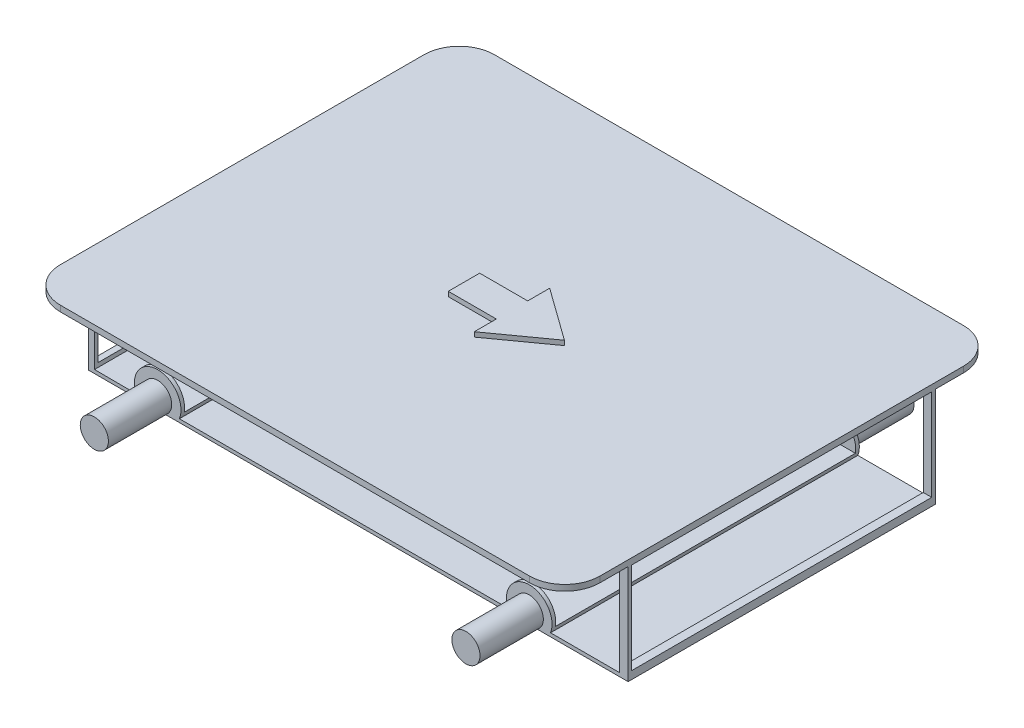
ISO-10303-21;
HEADER;
FILE_DESCRIPTION(('STEP AP214'),'2;1');
FILE_NAME('part.step','',(''),(''),'','','');
FILE_SCHEMA(('AUTOMOTIVE_DESIGN { 1 0 10303 214 1 1 1 1 }'));
ENDSEC;
DATA;
#1=APPLICATION_CONTEXT('core data for automotive mechanical design processes');
#2=APPLICATION_PROTOCOL_DEFINITION('international standard','automotive_design',2000,#1);
#3=PRODUCT_CONTEXT('',#1,'mechanical');
#4=PRODUCT('Part','Part','',(#3));
#5=PRODUCT_RELATED_PRODUCT_CATEGORY('part','',(#4));
#6=PRODUCT_DEFINITION_FORMATION('','',#4);
#7=PRODUCT_DEFINITION_CONTEXT('part definition',#1,'design');
#8=PRODUCT_DEFINITION('design','',#6,#7);
#9=PRODUCT_DEFINITION_SHAPE('','',#8);
#10=(LENGTH_UNIT() NAMED_UNIT(*) SI_UNIT(.MILLI.,.METRE.));
#11=(NAMED_UNIT(*) PLANE_ANGLE_UNIT() SI_UNIT($,.RADIAN.));
#12=(NAMED_UNIT(*) SI_UNIT($,.STERADIAN.) SOLID_ANGLE_UNIT());
#13=UNCERTAINTY_MEASURE_WITH_UNIT(LENGTH_MEASURE(1.E-05),#10,'distance_accuracy_value','');
#14=(GEOMETRIC_REPRESENTATION_CONTEXT(3) GLOBAL_UNCERTAINTY_ASSIGNED_CONTEXT((#13)) GLOBAL_UNIT_ASSIGNED_CONTEXT((#10,
#11,#12)) REPRESENTATION_CONTEXT('',''));
#15=CARTESIAN_POINT('',(0.,0.,0.));
#16=DIRECTION('',(0.,0.,1.));
#17=DIRECTION('',(1.,0.,0.));
#18=AXIS2_PLACEMENT_3D('',#15,#16,#17);
#19=CARTESIAN_POINT('',(-112.483753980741,40.9274589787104,-92.5));
#20=DIRECTION('',(0.,1.,0.));
#21=DIRECTION('',(0.,0.,1.));
#22=AXIS2_PLACEMENT_3D('',#19,#20,#21);
#23=PLANE('',#22);
#24=DIRECTION('',(0.,0.,1.));
#25=VECTOR('',#24,1.);
#26=CARTESIAN_POINT('',(111.392309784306,40.9274589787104,-92.5));
#27=LINE('',#26,#25);
#28=CARTESIAN_POINT('',(111.392309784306,40.9274589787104,-65.5));
#29=VERTEX_POINT('',#28);
#30=CARTESIAN_POINT('',(111.392309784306,40.9274589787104,-63.9471018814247));
#31=VERTEX_POINT('',#30);
#32=EDGE_CURVE('E471',#29,#31,#27,.T.);
#33=ORIENTED_EDGE('',*,*,#32,.T.);
#34=DIRECTION('',(-1.,0.,0.));
#35=VECTOR('',#34,1.);
#36=CARTESIAN_POINT('',(-112.483753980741,40.9274589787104,-63.9471018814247));
#37=LINE('',#36,#35);
#38=CARTESIAN_POINT('',(-112.483753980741,40.9274589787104,-63.9471018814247));
#39=VERTEX_POINT('',#38);
#40=EDGE_CURVE('E422',#31,#39,#37,.T.);
#41=ORIENTED_EDGE('',*,*,#40,.T.);
#42=DIRECTION('',(0.,0.,1.));
#43=VECTOR('',#42,1.);
#44=CARTESIAN_POINT('',(-112.483753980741,40.9274589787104,-92.5));
#45=LINE('',#44,#43);
#46=CARTESIAN_POINT('',(-112.483753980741,40.9274589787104,-65.5));
#47=VERTEX_POINT('',#46);
#48=EDGE_CURVE('E466',#47,#39,#45,.T.);
#49=ORIENTED_EDGE('',*,*,#48,.F.);
#50=DIRECTION('',(1.,0.,0.));
#51=VECTOR('',#50,1.);
#52=CARTESIAN_POINT('',(0.,40.9274589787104,-65.5));
#53=LINE('',#52,#51);
#54=EDGE_CURVE('E706',#47,#29,#53,.T.);
#55=ORIENTED_EDGE('',*,*,#54,.T.);
#56=EDGE_LOOP('',(#33,#41,#49,#55));
#57=FACE_BOUND('',#56,.T.);
#58=ADVANCED_FACE('F47',(#57),#23,.F.);
#59=CARTESIAN_POINT('',(0.,0.,65.5));
#60=DIRECTION('',(0.,0.,1.));
#61=DIRECTION('',(1.,0.,0.));
#62=AXIS2_PLACEMENT_3D('',#59,#60,#61);
#63=PLANE('',#62);
#64=DIRECTION('',(1.,0.,0.));
#65=VECTOR('',#64,1.);
#66=CARTESIAN_POINT('',(-115.,0.,65.5));
#67=LINE('',#66,#65);
#68=CARTESIAN_POINT('',(-82.2619010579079,0.,65.5));
#69=VERTEX_POINT('',#68);
#70=CARTESIAN_POINT('',(69.5470831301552,0.,65.5));
#71=VERTEX_POINT('',#70);
#72=EDGE_CURVE('E1421',#69,#71,#67,.T.);
#73=ORIENTED_EDGE('',*,*,#72,.T.);
#74=CARTESIAN_POINT('',(72.8637079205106,5.,65.5));
#75=DIRECTION('',(0.,0.,1.));
#76=DIRECTION('',(1.,0.,0.));
#77=AXIS2_PLACEMENT_3D('',#74,#75,#76);
#78=CIRCLE('',#77,6.);
#79=CARTESIAN_POINT('',(76.180332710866,0.,65.5));
#80=VERTEX_POINT('',#79);
#81=EDGE_CURVE('E678',#71,#80,#78,.F.);
#82=ORIENTED_EDGE('',*,*,#81,.T.);
#83=CARTESIAN_POINT('',(115.,0.,65.5));
#84=VERTEX_POINT('',#83);
#85=EDGE_CURVE('E629',#80,#84,#67,.T.);
#86=ORIENTED_EDGE('',*,*,#85,.T.);
#87=DIRECTION('',(0.,1.,0.));
#88=VECTOR('',#87,1.);
#89=CARTESIAN_POINT('',(115.,42.5,65.5));
#90=LINE('',#89,#88);
#91=CARTESIAN_POINT('',(115.,42.5,65.5));
#92=VERTEX_POINT('',#91);
#93=EDGE_CURVE('E634',#84,#92,#90,.T.);
#94=ORIENTED_EDGE('',*,*,#93,.T.);
#95=DIRECTION('',(-1.,0.,0.));
#96=VECTOR('',#95,1.);
#97=CARTESIAN_POINT('',(-115.,42.5,65.5));
#98=LINE('',#97,#96);
#99=CARTESIAN_POINT('',(-115.,42.5,65.5));
#100=VERTEX_POINT('',#99);
#101=EDGE_CURVE('E638',#92,#100,#98,.T.);
#102=ORIENTED_EDGE('',*,*,#101,.T.);
#103=DIRECTION('',(0.,-1.,0.));
#104=VECTOR('',#103,1.);
#105=CARTESIAN_POINT('',(-115.,42.5,65.5));
#106=LINE('',#105,#104);
#107=CARTESIAN_POINT('',(-115.,0.,65.5));
#108=VERTEX_POINT('',#107);
#109=EDGE_CURVE('E625',#100,#108,#106,.T.);
#110=ORIENTED_EDGE('',*,*,#109,.T.);
#111=CARTESIAN_POINT('',(-88.8951506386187,0.,65.5));
#112=VERTEX_POINT('',#111);
#113=EDGE_CURVE('E630',#108,#112,#67,.T.);
#114=ORIENTED_EDGE('',*,*,#113,.T.);
#115=CARTESIAN_POINT('',(-85.5785258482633,5.,65.5));
#116=DIRECTION('',(0.,0.,1.));
#117=DIRECTION('',(1.,0.,0.));
#118=AXIS2_PLACEMENT_3D('',#115,#116,#117);
#119=CIRCLE('',#118,6.);
#120=EDGE_CURVE('E669',#112,#69,#119,.F.);
#121=ORIENTED_EDGE('',*,*,#120,.T.);
#122=EDGE_LOOP('',(#73,#82,#86,#94,#102,#110,#114,#121));
#123=FACE_BOUND('',#122,.T.);
#124=DIRECTION('',(0.999985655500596,-0.00535619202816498,0.));
#125=VECTOR('',#124,1.);
#126=CARTESIAN_POINT('',(-94.8490531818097,1.42667230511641,65.5));
#127=LINE('',#126,#125);
#128=CARTESIAN_POINT('',(-112.483753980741,1.52112850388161,65.5));
#129=VERTEX_POINT('',#128);
#130=CARTESIAN_POINT('',(-94.8490531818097,1.42667230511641,65.5));
#131=VERTEX_POINT('',#130);
#132=EDGE_CURVE('E430',#129,#131,#127,.T.);
#133=ORIENTED_EDGE('',*,*,#132,.F.);
#134=DIRECTION('',(0.,-1.,0.));
#135=VECTOR('',#134,1.);
#136=CARTESIAN_POINT('',(-112.483753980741,1.52112850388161,65.5));
#137=LINE('',#136,#135);
#138=CARTESIAN_POINT('',(-112.483753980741,40.9274589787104,65.5));
#139=VERTEX_POINT('',#138);
#140=EDGE_CURVE('E457',#139,#129,#137,.T.);
#141=ORIENTED_EDGE('',*,*,#140,.F.);
#142=DIRECTION('',(-1.,0.,0.));
#143=VECTOR('',#142,1.);
#144=CARTESIAN_POINT('',(-112.483753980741,40.9274589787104,65.5));
#145=LINE('',#144,#143);
#146=CARTESIAN_POINT('',(111.392309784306,40.9274589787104,65.5));
#147=VERTEX_POINT('',#146);
#148=EDGE_CURVE('E453',#147,#139,#145,.T.);
#149=ORIENTED_EDGE('',*,*,#148,.F.);
#150=DIRECTION('',(0.,1.,0.));
#151=VECTOR('',#150,1.);
#152=CARTESIAN_POINT('',(111.392309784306,40.9274589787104,65.5));
#153=LINE('',#152,#151);
#154=CARTESIAN_POINT('',(111.392309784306,1.52112850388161,65.5));
#155=VERTEX_POINT('',#154);
#156=EDGE_CURVE('E449',#155,#147,#153,.T.);
#157=ORIENTED_EDGE('',*,*,#156,.F.);
#158=DIRECTION('',(1.,0.,0.));
#159=VECTOR('',#158,1.);
#160=CARTESIAN_POINT('',(111.392309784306,1.52112850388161,65.5));
#161=LINE('',#160,#159);
#162=CARTESIAN_POINT('',(81.9413062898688,1.52112850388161,65.5));
#163=VERTEX_POINT('',#162);
#164=EDGE_CURVE('E445',#163,#155,#161,.T.);
#165=ORIENTED_EDGE('',*,*,#164,.F.);
#166=CARTESIAN_POINT('',(72.8637079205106,5.,65.5));
#167=DIRECTION('',(0.,0.,-1.));
#168=DIRECTION('',(1.,0.,0.));
#169=AXIS2_PLACEMENT_3D('',#166,#167,#168);
#170=CIRCLE('',#169,9.72138565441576);
#171=CARTESIAN_POINT('',(63.7861095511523,1.5211285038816,65.5));
#172=VERTEX_POINT('',#171);
#173=EDGE_CURVE('E441',#172,#163,#170,.T.);
#174=ORIENTED_EDGE('',*,*,#173,.F.);
#175=DIRECTION('',(0.999999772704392,0.000674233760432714,0.));
#176=VECTOR('',#175,1.);
#177=CARTESIAN_POINT('',(63.7861095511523,1.52112850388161,65.5));
#178=LINE('',#177,#176);
#179=CARTESIAN_POINT('',(-76.3079985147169,1.42667230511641,65.5));
#180=VERTEX_POINT('',#179);
#181=EDGE_CURVE('E437',#180,#172,#178,.T.);
#182=ORIENTED_EDGE('',*,*,#181,.F.);
#183=CARTESIAN_POINT('',(-85.5785258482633,5.,65.5));
#184=DIRECTION('',(0.,0.,-1.));
#185=DIRECTION('',(1.,0.,0.));
#186=AXIS2_PLACEMENT_3D('',#183,#184,#185);
#187=CIRCLE('',#186,9.93535846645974);
#188=EDGE_CURVE('E433',#131,#180,#187,.T.);
#189=ORIENTED_EDGE('',*,*,#188,.F.);
#190=EDGE_LOOP('',(#133,#141,#149,#157,#165,#174,#182,#189));
#191=FACE_BOUND('',#190,.T.);
#192=ADVANCED_FACE('F825',(#123,#191),#63,.T.);
#193=CARTESIAN_POINT('',(0.,0.,-65.5));
#194=DIRECTION('',(0.,0.,-1.));
#195=DIRECTION('',(1.,0.,0.));
#196=AXIS2_PLACEMENT_3D('',#193,#194,#195);
#197=PLANE('',#196);
#198=CARTESIAN_POINT('',(72.8637079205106,5.,-65.5));
#199=DIRECTION('',(0.,0.,-1.));
#200=DIRECTION('',(-1.,0.,0.));
#201=AXIS2_PLACEMENT_3D('',#198,#199,#200);
#202=CIRCLE('',#201,6.);
#203=CARTESIAN_POINT('',(69.5470831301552,0.,-65.5));
#204=VERTEX_POINT('',#203);
#205=CARTESIAN_POINT('',(76.180332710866,0.,-65.5));
#206=VERTEX_POINT('',#205);
#207=EDGE_CURVE('E686',#204,#206,#202,.T.);
#208=ORIENTED_EDGE('',*,*,#207,.F.);
#209=DIRECTION('',(1.,0.,0.));
#210=VECTOR('',#209,1.);
#211=CARTESIAN_POINT('',(-115.,0.,-65.5));
#212=LINE('',#211,#210);
#213=CARTESIAN_POINT('',(-82.2619010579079,0.,-65.5));
#214=VERTEX_POINT('',#213);
#215=EDGE_CURVE('E1435',#214,#204,#212,.T.);
#216=ORIENTED_EDGE('',*,*,#215,.F.);
#217=CARTESIAN_POINT('',(-85.5785258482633,5.,-65.5));
#218=DIRECTION('',(0.,0.,-1.));
#219=DIRECTION('',(-1.,0.,0.));
#220=AXIS2_PLACEMENT_3D('',#217,#218,#219);
#221=CIRCLE('',#220,6.);
#222=CARTESIAN_POINT('',(-88.8951506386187,0.,-65.5));
#223=VERTEX_POINT('',#222);
#224=EDGE_CURVE('E682',#223,#214,#221,.T.);
#225=ORIENTED_EDGE('',*,*,#224,.F.);
#226=CARTESIAN_POINT('',(-115.,0.,-65.5));
#227=VERTEX_POINT('',#226);
#228=EDGE_CURVE('E608',#227,#223,#212,.T.);
#229=ORIENTED_EDGE('',*,*,#228,.F.);
#230=DIRECTION('',(0.,-1.,0.));
#231=VECTOR('',#230,1.);
#232=CARTESIAN_POINT('',(-115.,42.5,-65.5));
#233=LINE('',#232,#231);
#234=CARTESIAN_POINT('',(-115.,42.5,-65.5));
#235=VERTEX_POINT('',#234);
#236=EDGE_CURVE('E596',#235,#227,#233,.T.);
#237=ORIENTED_EDGE('',*,*,#236,.F.);
#238=DIRECTION('',(-1.,0.,0.));
#239=VECTOR('',#238,1.);
#240=CARTESIAN_POINT('',(-115.,42.5,-65.5));
#241=LINE('',#240,#239);
#242=CARTESIAN_POINT('',(115.,42.5,-65.5));
#243=VERTEX_POINT('',#242);
#244=EDGE_CURVE('E600',#243,#235,#241,.T.);
#245=ORIENTED_EDGE('',*,*,#244,.F.);
#246=DIRECTION('',(0.,1.,0.));
#247=VECTOR('',#246,1.);
#248=CARTESIAN_POINT('',(115.,42.5,-65.5));
#249=LINE('',#248,#247);
#250=CARTESIAN_POINT('',(115.,0.,-65.5));
#251=VERTEX_POINT('',#250);
#252=EDGE_CURVE('E603',#251,#243,#249,.T.);
#253=ORIENTED_EDGE('',*,*,#252,.F.);
#254=EDGE_CURVE('E607',#206,#251,#212,.T.);
#255=ORIENTED_EDGE('',*,*,#254,.F.);
#256=EDGE_LOOP('',(#208,#216,#225,#229,#237,#245,#253,#255));
#257=FACE_BOUND('',#256,.T.);
#258=DIRECTION('',(-0.999985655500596,0.00535619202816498,0.));
#259=VECTOR('',#258,1.);
#260=CARTESIAN_POINT('',(0.00492031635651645,0.918608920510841,-65.5));
#261=LINE('',#260,#259);
#262=CARTESIAN_POINT('',(-94.8490531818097,1.42667230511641,-65.5));
#263=VERTEX_POINT('',#262);
#264=CARTESIAN_POINT('',(-112.483753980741,1.52112850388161,-65.5));
#265=VERTEX_POINT('',#264);
#266=EDGE_CURVE('E712',#263,#265,#261,.T.);
#267=ORIENTED_EDGE('',*,*,#266,.F.);
#268=CARTESIAN_POINT('',(-85.5785258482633,5.,-65.5));
#269=DIRECTION('',(0.,0.,-1.));
#270=DIRECTION('',(-1.,0.,0.));
#271=AXIS2_PLACEMENT_3D('',#268,#269,#270);
#272=CIRCLE('',#271,9.93535846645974);
#273=CARTESIAN_POINT('',(-76.3079985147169,1.42667230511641,-65.5));
#274=VERTEX_POINT('',#273);
#275=EDGE_CURVE('E690',#274,#263,#272,.F.);
#276=ORIENTED_EDGE('',*,*,#275,.F.);
#277=DIRECTION('',(-0.999999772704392,-0.000674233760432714,0.));
#278=VECTOR('',#277,1.);
#279=CARTESIAN_POINT('',(-0.000996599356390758,1.47812107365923,-65.5));
#280=LINE('',#279,#278);
#281=CARTESIAN_POINT('',(63.7861095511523,1.5211285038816,-65.5));
#282=VERTEX_POINT('',#281);
#283=EDGE_CURVE('E693',#282,#274,#280,.T.);
#284=ORIENTED_EDGE('',*,*,#283,.F.);
#285=CARTESIAN_POINT('',(72.8637079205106,5.,-65.5));
#286=DIRECTION('',(0.,0.,-1.));
#287=DIRECTION('',(-1.,0.,0.));
#288=AXIS2_PLACEMENT_3D('',#285,#286,#287);
#289=CIRCLE('',#288,9.72138565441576);
#290=CARTESIAN_POINT('',(81.9413062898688,1.52112850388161,-65.5));
#291=VERTEX_POINT('',#290);
#292=EDGE_CURVE('E697',#291,#282,#289,.F.);
#293=ORIENTED_EDGE('',*,*,#292,.F.);
#294=DIRECTION('',(-1.,0.,0.));
#295=VECTOR('',#294,1.);
#296=CARTESIAN_POINT('',(0.,1.52112850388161,-65.5));
#297=LINE('',#296,#295);
#298=CARTESIAN_POINT('',(111.392309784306,1.52112850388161,-65.5));
#299=VERTEX_POINT('',#298);
#300=EDGE_CURVE('E700',#299,#291,#297,.T.);
#301=ORIENTED_EDGE('',*,*,#300,.F.);
#302=DIRECTION('',(0.,-1.,0.));
#303=VECTOR('',#302,1.);
#304=CARTESIAN_POINT('',(111.392309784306,0.,-65.5));
#305=LINE('',#304,#303);
#306=EDGE_CURVE('E703',#29,#299,#305,.T.);
#307=ORIENTED_EDGE('',*,*,#306,.F.);
#308=ORIENTED_EDGE('',*,*,#54,.F.);
#309=DIRECTION('',(0.,1.,0.));
#310=VECTOR('',#309,1.);
#311=CARTESIAN_POINT('',(-112.483753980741,0.,-65.5));
#312=LINE('',#311,#310);
#313=EDGE_CURVE('E709',#265,#47,#312,.T.);
#314=ORIENTED_EDGE('',*,*,#313,.F.);
#315=EDGE_LOOP('',(#267,#276,#284,#293,#301,#307,#308,#314));
#316=FACE_BOUND('',#315,.T.);
#317=ADVANCED_FACE('F812',(#257,#316),#197,.T.);
#318=CARTESIAN_POINT('',(0.,0.,0.));
#319=DIRECTION('',(0.,-1.,0.));
#320=DIRECTION('',(0.,0.,-1.));
#321=AXIS2_PLACEMENT_3D('',#318,#319,#320);
#322=PLANE('',#321);
#323=DIRECTION('',(0.,0.,1.));
#324=VECTOR('',#323,1.);
#325=CARTESIAN_POINT('',(-115.,0.,92.5));
#326=LINE('',#325,#324);
#327=EDGE_CURVE('E657',#227,#108,#326,.T.);
#328=ORIENTED_EDGE('',*,*,#327,.F.);
#329=ORIENTED_EDGE('',*,*,#228,.T.);
#330=EDGE_CURVE('E613',#223,#214,#212,.T.);
#331=ORIENTED_EDGE('',*,*,#330,.T.);
#332=ORIENTED_EDGE('',*,*,#215,.T.);
#333=EDGE_CURVE('E1432',#204,#206,#212,.T.);
#334=ORIENTED_EDGE('',*,*,#333,.T.);
#335=ORIENTED_EDGE('',*,*,#254,.T.);
#336=DIRECTION('',(0.,0.,-1.));
#337=VECTOR('',#336,1.);
#338=CARTESIAN_POINT('',(115.,0.,92.5));
#339=LINE('',#338,#337);
#340=EDGE_CURVE('E649',#84,#251,#339,.T.);
#341=ORIENTED_EDGE('',*,*,#340,.F.);
#342=ORIENTED_EDGE('',*,*,#85,.F.);
#343=EDGE_CURVE('E1423',#71,#80,#67,.T.);
#344=ORIENTED_EDGE('',*,*,#343,.F.);
#345=ORIENTED_EDGE('',*,*,#72,.F.);
#346=EDGE_CURVE('E635',#112,#69,#67,.T.);
#347=ORIENTED_EDGE('',*,*,#346,.F.);
#348=ORIENTED_EDGE('',*,*,#113,.F.);
#349=EDGE_LOOP('',(#328,#329,#331,#332,#334,#335,#341,#342,#344,#345,#347,#348));
#350=FACE_BOUND('',#349,.T.);
#351=ADVANCED_FACE('F818',(#350),#322,.T.);
#352=CARTESIAN_POINT('',(115.,45.,92.5));
#353=DIRECTION('',(-1.,0.,0.));
#354=DIRECTION('',(0.,0.,1.));
#355=AXIS2_PLACEMENT_3D('',#352,#353,#354);
#356=PLANE('',#355);
#357=DIRECTION('',(0.,0.,-1.));
#358=VECTOR('',#357,1.);
#359=CARTESIAN_POINT('',(115.,42.3225457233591,63.9471018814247));
#360=LINE('',#359,#358);
#361=CARTESIAN_POINT('',(115.,42.3225457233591,63.9471018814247));
#362=VERTEX_POINT('',#361);
#363=CARTESIAN_POINT('',(115.,42.3225457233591,-63.9471018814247));
#364=VERTEX_POINT('',#363);
#365=EDGE_CURVE('E353',#362,#364,#360,.T.);
#366=ORIENTED_EDGE('',*,*,#365,.T.);
#367=DIRECTION('',(0.,-1.,0.));
#368=VECTOR('',#367,1.);
#369=CARTESIAN_POINT('',(115.,42.3225457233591,-63.9471018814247));
#370=LINE('',#369,#368);
#371=CARTESIAN_POINT('',(115.,3.32894642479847,-63.9471018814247));
#372=VERTEX_POINT('',#371);
#373=EDGE_CURVE('E328',#364,#372,#370,.T.);
#374=ORIENTED_EDGE('',*,*,#373,.T.);
#375=DIRECTION('',(0.,0.,1.));
#376=VECTOR('',#375,1.);
#377=CARTESIAN_POINT('',(115.,3.32894642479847,63.9471018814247));
#378=LINE('',#377,#376);
#379=CARTESIAN_POINT('',(115.,3.32894642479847,63.9471018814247));
#380=VERTEX_POINT('',#379);
#381=EDGE_CURVE('E341',#372,#380,#378,.T.);
#382=ORIENTED_EDGE('',*,*,#381,.T.);
#383=DIRECTION('',(0.,1.,0.));
#384=VECTOR('',#383,1.);
#385=CARTESIAN_POINT('',(115.,42.3225457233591,63.9471018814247));
#386=LINE('',#385,#384);
#387=EDGE_CURVE('E348',#380,#362,#386,.T.);
#388=ORIENTED_EDGE('',*,*,#387,.T.);
#389=EDGE_LOOP('',(#366,#374,#382,#388));
#390=FACE_BOUND('',#389,.T.);
#391=DIRECTION('',(0.,0.,-1.));
#392=VECTOR('',#391,1.);
#393=CARTESIAN_POINT('',(115.,42.5,-65.5));
#394=LINE('',#393,#392);
#395=CARTESIAN_POINT('',(115.,42.5,-77.5));
#396=VERTEX_POINT('',#395);
#397=EDGE_CURVE('E617',#243,#396,#394,.T.);
#398=ORIENTED_EDGE('',*,*,#397,.T.);
#399=DIRECTION('',(0.,-1.,0.));
#400=VECTOR('',#399,1.);
#401=CARTESIAN_POINT('',(115.,45.,-77.5));
#402=LINE('',#401,#400);
#403=CARTESIAN_POINT('',(115.,45.,-77.5));
#404=VERTEX_POINT('',#403);
#405=EDGE_CURVE('E767',#396,#404,#402,.F.);
#406=ORIENTED_EDGE('',*,*,#405,.T.);
#407=DIRECTION('',(0.,0.,-1.));
#408=VECTOR('',#407,1.);
#409=CARTESIAN_POINT('',(115.,45.,92.5));
#410=LINE('',#409,#408);
#411=CARTESIAN_POINT('',(115.,45.,77.5));
#412=VERTEX_POINT('',#411);
#413=EDGE_CURVE('E652',#412,#404,#410,.T.);
#414=ORIENTED_EDGE('',*,*,#413,.F.);
#415=DIRECTION('',(0.,-1.,0.));
#416=VECTOR('',#415,1.);
#417=CARTESIAN_POINT('',(115.,45.,77.5));
#418=LINE('',#417,#416);
#419=CARTESIAN_POINT('',(115.,42.5,77.5));
#420=VERTEX_POINT('',#419);
#421=EDGE_CURVE('E763',#412,#420,#418,.T.);
#422=ORIENTED_EDGE('',*,*,#421,.T.);
#423=DIRECTION('',(0.,0.,1.));
#424=VECTOR('',#423,1.);
#425=CARTESIAN_POINT('',(115.,42.5,65.5));
#426=LINE('',#425,#424);
#427=EDGE_CURVE('E642',#92,#420,#426,.T.);
#428=ORIENTED_EDGE('',*,*,#427,.F.);
#429=ORIENTED_EDGE('',*,*,#93,.F.);
#430=ORIENTED_EDGE('',*,*,#340,.T.);
#431=ORIENTED_EDGE('',*,*,#252,.T.);
#432=EDGE_LOOP('',(#398,#406,#414,#422,#428,#429,#430,#431));
#433=FACE_BOUND('',#432,.T.);
#434=ADVANCED_FACE('F350',(#390,#433),#356,.F.);
#435=CARTESIAN_POINT('',(-115.,45.,-92.5));
#436=DIRECTION('',(0.,0.,1.));
#437=DIRECTION('',(1.,0.,0.));
#438=AXIS2_PLACEMENT_3D('',#435,#436,#437);
#439=PLANE('',#438);
#440=DIRECTION('',(-1.,0.,0.));
#441=VECTOR('',#440,1.);
#442=CARTESIAN_POINT('',(-115.,42.5,-92.5));
#443=LINE('',#442,#441);
#444=CARTESIAN_POINT('',(100.,42.5,-92.5));
#445=VERTEX_POINT('',#444);
#446=CARTESIAN_POINT('',(-100.,42.5,-92.5));
#447=VERTEX_POINT('',#446);
#448=EDGE_CURVE('E593',#445,#447,#443,.T.);
#449=ORIENTED_EDGE('',*,*,#448,.T.);
#450=DIRECTION('',(0.,-1.,0.));
#451=VECTOR('',#450,1.);
#452=CARTESIAN_POINT('',(-100.,45.,-92.5));
#453=LINE('',#452,#451);
#454=CARTESIAN_POINT('',(-100.,45.,-92.5));
#455=VERTEX_POINT('',#454);
#456=EDGE_CURVE('E748',#447,#455,#453,.F.);
#457=ORIENTED_EDGE('',*,*,#456,.T.);
#458=DIRECTION('',(-1.,0.,0.));
#459=VECTOR('',#458,1.);
#460=CARTESIAN_POINT('',(-115.,45.,-92.5));
#461=LINE('',#460,#459);
#462=CARTESIAN_POINT('',(100.,45.,-92.5));
#463=VERTEX_POINT('',#462);
#464=EDGE_CURVE('E656',#463,#455,#461,.T.);
#465=ORIENTED_EDGE('',*,*,#464,.F.);
#466=DIRECTION('',(0.,-1.,0.));
#467=VECTOR('',#466,1.);
#468=CARTESIAN_POINT('',(100.,45.,-92.5));
#469=LINE('',#468,#467);
#470=EDGE_CURVE('E744',#463,#445,#469,.T.);
#471=ORIENTED_EDGE('',*,*,#470,.T.);
#472=EDGE_LOOP('',(#449,#457,#465,#471));
#473=FACE_BOUND('',#472,.T.);
#474=ADVANCED_FACE('F798',(#473),#439,.F.);
#475=CARTESIAN_POINT('',(-115.,45.,92.5));
#476=DIRECTION('',(1.,0.,0.));
#477=DIRECTION('',(0.,0.,-1.));
#478=AXIS2_PLACEMENT_3D('',#475,#476,#477);
#479=PLANE('',#478);
#480=DIRECTION('',(0.,0.,1.));
#481=VECTOR('',#480,1.);
#482=CARTESIAN_POINT('',(-115.,3.32894642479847,63.9471018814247));
#483=LINE('',#482,#481);
#484=CARTESIAN_POINT('',(-115.,3.32894642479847,-63.9471018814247));
#485=VERTEX_POINT('',#484);
#486=CARTESIAN_POINT('',(-115.,3.32894642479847,63.9471018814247));
#487=VERTEX_POINT('',#486);
#488=EDGE_CURVE('E369',#485,#487,#483,.T.);
#489=ORIENTED_EDGE('',*,*,#488,.F.);
#490=DIRECTION('',(0.,-1.,0.));
#491=VECTOR('',#490,1.);
#492=CARTESIAN_POINT('',(-115.,42.3225457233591,-63.9471018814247));
#493=LINE('',#492,#491);
#494=CARTESIAN_POINT('',(-115.,42.3225457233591,-63.9471018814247));
#495=VERTEX_POINT('',#494);
#496=EDGE_CURVE('E366',#495,#485,#493,.T.);
#497=ORIENTED_EDGE('',*,*,#496,.F.);
#498=DIRECTION('',(0.,0.,-1.));
#499=VECTOR('',#498,1.);
#500=CARTESIAN_POINT('',(-115.,42.3225457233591,63.9471018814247));
#501=LINE('',#500,#499);
#502=CARTESIAN_POINT('',(-115.,42.3225457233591,63.9471018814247));
#503=VERTEX_POINT('',#502);
#504=EDGE_CURVE('E355',#503,#495,#501,.T.);
#505=ORIENTED_EDGE('',*,*,#504,.F.);
#506=DIRECTION('',(0.,1.,0.));
#507=VECTOR('',#506,1.);
#508=CARTESIAN_POINT('',(-115.,42.3225457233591,63.9471018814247));
#509=LINE('',#508,#507);
#510=EDGE_CURVE('E359',#487,#503,#509,.T.);
#511=ORIENTED_EDGE('',*,*,#510,.F.);
#512=EDGE_LOOP('',(#489,#497,#505,#511));
#513=FACE_BOUND('',#512,.T.);
#514=DIRECTION('',(0.,0.,1.));
#515=VECTOR('',#514,1.);
#516=CARTESIAN_POINT('',(-115.,45.,92.5));
#517=LINE('',#516,#515);
#518=CARTESIAN_POINT('',(-115.,45.,-77.5));
#519=VERTEX_POINT('',#518);
#520=CARTESIAN_POINT('',(-115.,45.,77.5));
#521=VERTEX_POINT('',#520);
#522=EDGE_CURVE('E661',#519,#521,#517,.T.);
#523=ORIENTED_EDGE('',*,*,#522,.F.);
#524=DIRECTION('',(0.,-1.,0.));
#525=VECTOR('',#524,1.);
#526=CARTESIAN_POINT('',(-115.,45.,-77.5));
#527=LINE('',#526,#525);
#528=CARTESIAN_POINT('',(-115.,42.5,-77.5));
#529=VERTEX_POINT('',#528);
#530=EDGE_CURVE('E734',#519,#529,#527,.T.);
#531=ORIENTED_EDGE('',*,*,#530,.T.);
#532=DIRECTION('',(0.,0.,-1.));
#533=VECTOR('',#532,1.);
#534=CARTESIAN_POINT('',(-115.,42.5,-65.5));
#535=LINE('',#534,#533);
#536=EDGE_CURVE('E612',#235,#529,#535,.T.);
#537=ORIENTED_EDGE('',*,*,#536,.F.);
#538=ORIENTED_EDGE('',*,*,#236,.T.);
#539=ORIENTED_EDGE('',*,*,#327,.T.);
#540=ORIENTED_EDGE('',*,*,#109,.F.);
#541=DIRECTION('',(0.,0.,1.));
#542=VECTOR('',#541,1.);
#543=CARTESIAN_POINT('',(-115.,42.5,65.5));
#544=LINE('',#543,#542);
#545=CARTESIAN_POINT('',(-115.,42.5,77.5));
#546=VERTEX_POINT('',#545);
#547=EDGE_CURVE('E645',#100,#546,#544,.T.);
#548=ORIENTED_EDGE('',*,*,#547,.T.);
#549=DIRECTION('',(0.,-1.,0.));
#550=VECTOR('',#549,1.);
#551=CARTESIAN_POINT('',(-115.,45.,77.5));
#552=LINE('',#551,#550);
#553=EDGE_CURVE('E731',#546,#521,#552,.F.);
#554=ORIENTED_EDGE('',*,*,#553,.T.);
#555=EDGE_LOOP('',(#523,#531,#537,#538,#539,#540,#548,#554));
#556=FACE_BOUND('',#555,.T.);
#557=ADVANCED_FACE('F784',(#513,#556),#479,.F.);
#558=CARTESIAN_POINT('',(-115.,45.,92.5));
#559=DIRECTION('',(0.,0.,-1.));
#560=DIRECTION('',(-1.,0.,0.));
#561=AXIS2_PLACEMENT_3D('',#558,#559,#560);
#562=PLANE('',#561);
#563=DIRECTION('',(-1.,0.,0.));
#564=VECTOR('',#563,1.);
#565=CARTESIAN_POINT('',(-115.,42.5,92.5));
#566=LINE('',#565,#564);
#567=CARTESIAN_POINT('',(100.,42.5,92.5));
#568=VERTEX_POINT('',#567);
#569=CARTESIAN_POINT('',(-100.,42.5,92.5));
#570=VERTEX_POINT('',#569);
#571=EDGE_CURVE('E621',#568,#570,#566,.T.);
#572=ORIENTED_EDGE('',*,*,#571,.F.);
#573=DIRECTION('',(0.,-1.,0.));
#574=VECTOR('',#573,1.);
#575=CARTESIAN_POINT('',(100.,45.,92.5));
#576=LINE('',#575,#574);
#577=CARTESIAN_POINT('',(100.,45.,92.5));
#578=VERTEX_POINT('',#577);
#579=EDGE_CURVE('E11',#568,#578,#576,.F.);
#580=ORIENTED_EDGE('',*,*,#579,.T.);
#581=DIRECTION('',(1.,0.,0.));
#582=VECTOR('',#581,1.);
#583=CARTESIAN_POINT('',(-115.,45.,92.5));
#584=LINE('',#583,#582);
#585=CARTESIAN_POINT('',(-100.,45.,92.5));
#586=VERTEX_POINT('',#585);
#587=EDGE_CURVE('E665',#586,#578,#584,.T.);
#588=ORIENTED_EDGE('',*,*,#587,.F.);
#589=DIRECTION('',(0.,-1.,0.));
#590=VECTOR('',#589,1.);
#591=CARTESIAN_POINT('',(-100.,45.,92.5));
#592=LINE('',#591,#590);
#593=EDGE_CURVE('E56',#586,#570,#592,.T.);
#594=ORIENTED_EDGE('',*,*,#593,.T.);
#595=EDGE_LOOP('',(#572,#580,#588,#594));
#596=FACE_BOUND('',#595,.T.);
#597=ADVANCED_FACE('F776',(#596),#562,.F.);
#598=CARTESIAN_POINT('',(0.,45.,0.));
#599=DIRECTION('',(0.,-1.,0.));
#600=DIRECTION('',(0.,0.,-1.));
#601=AXIS2_PLACEMENT_3D('',#598,#599,#600);
#602=PLANE('',#601);
#603=DIRECTION('',(1.,0.,0.));
#604=VECTOR('',#603,1.);
#605=CARTESIAN_POINT('',(0.,45.,6.68609647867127));
#606=LINE('',#605,#604);
#607=CARTESIAN_POINT('',(-20.472829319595,45.,6.68609647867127));
#608=VERTEX_POINT('',#607);
#609=CARTESIAN_POINT('',(0.,45.,6.68609647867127));
#610=VERTEX_POINT('',#609);
#611=EDGE_CURVE('E521',#608,#610,#606,.T.);
#612=ORIENTED_EDGE('',*,*,#611,.F.);
#613=DIRECTION('',(0.,0.,-1.));
#614=VECTOR('',#613,1.);
#615=CARTESIAN_POINT('',(-20.472829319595,45.,0.));
#616=LINE('',#615,#614);
#617=CARTESIAN_POINT('',(-20.472829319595,45.,-6.68609647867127));
#618=VERTEX_POINT('',#617);
#619=EDGE_CURVE('E465',#608,#618,#616,.T.);
#620=ORIENTED_EDGE('',*,*,#619,.T.);
#621=DIRECTION('',(1.,0.,0.));
#622=VECTOR('',#621,1.);
#623=CARTESIAN_POINT('',(0.,45.,-6.68609647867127));
#624=LINE('',#623,#622);
#625=CARTESIAN_POINT('',(0.,45.,-6.68609647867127));
#626=VERTEX_POINT('',#625);
#627=EDGE_CURVE('E496',#618,#626,#624,.T.);
#628=ORIENTED_EDGE('',*,*,#627,.T.);
#629=DIRECTION('',(0.,0.,-1.));
#630=VECTOR('',#629,1.);
#631=CARTESIAN_POINT('',(0.,45.,0.));
#632=LINE('',#631,#630);
#633=CARTESIAN_POINT('',(0.,45.,-16.0630471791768));
#634=VERTEX_POINT('',#633);
#635=EDGE_CURVE('E535',#626,#634,#632,.T.);
#636=ORIENTED_EDGE('',*,*,#635,.T.);
#637=DIRECTION('',(0.812015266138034,0.,0.583636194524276));
#638=VECTOR('',#637,1.);
#639=CARTESIAN_POINT('',(7.61262341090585,45.,-10.5914720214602));
#640=LINE('',#639,#638);
#641=CARTESIAN_POINT('',(22.3485788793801,45.,0.));
#642=VERTEX_POINT('',#641);
#643=EDGE_CURVE('E531',#634,#642,#640,.T.);
#644=ORIENTED_EDGE('',*,*,#643,.T.);
#645=DIRECTION('',(0.812015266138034,0.,-0.583636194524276));
#646=VECTOR('',#645,1.);
#647=CARTESIAN_POINT('',(7.61262341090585,45.,10.5914720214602));
#648=LINE('',#647,#646);
#649=CARTESIAN_POINT('',(0.,45.,16.0630471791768));
#650=VERTEX_POINT('',#649);
#651=EDGE_CURVE('E527',#650,#642,#648,.T.);
#652=ORIENTED_EDGE('',*,*,#651,.F.);
#653=DIRECTION('',(0.,0.,1.));
#654=VECTOR('',#653,1.);
#655=CARTESIAN_POINT('',(0.,45.,0.));
#656=LINE('',#655,#654);
#657=EDGE_CURVE('E524',#610,#650,#656,.T.);
#658=ORIENTED_EDGE('',*,*,#657,.F.);
#659=EDGE_LOOP('',(#612,#620,#628,#636,#644,#652,#658));
#660=FACE_BOUND('',#659,.T.);
#661=ORIENTED_EDGE('',*,*,#464,.T.);
#662=CARTESIAN_POINT('',(-100.,45.,-77.5));
#663=DIRECTION('',(0.,-1.,0.));
#664=DIRECTION('',(0.,0.,-1.));
#665=AXIS2_PLACEMENT_3D('',#662,#663,#664);
#666=CIRCLE('',#665,15.);
#667=EDGE_CURVE('E760',#455,#519,#666,.F.);
#668=ORIENTED_EDGE('',*,*,#667,.T.);
#669=ORIENTED_EDGE('',*,*,#522,.T.);
#670=CARTESIAN_POINT('',(-100.,45.,77.5));
#671=DIRECTION('',(0.,-1.,0.));
#672=DIRECTION('',(0.,0.,-1.));
#673=AXIS2_PLACEMENT_3D('',#670,#671,#672);
#674=CIRCLE('',#673,15.);
#675=EDGE_CURVE('E751',#521,#586,#674,.F.);
#676=ORIENTED_EDGE('',*,*,#675,.T.);
#677=ORIENTED_EDGE('',*,*,#587,.T.);
#678=CARTESIAN_POINT('',(100.,45.,77.5));
#679=DIRECTION('',(0.,-1.,0.));
#680=DIRECTION('',(0.,0.,-1.));
#681=AXIS2_PLACEMENT_3D('',#678,#679,#680);
#682=CIRCLE('',#681,15.);
#683=EDGE_CURVE('E754',#578,#412,#682,.F.);
#684=ORIENTED_EDGE('',*,*,#683,.T.);
#685=ORIENTED_EDGE('',*,*,#413,.T.);
#686=CARTESIAN_POINT('',(100.,45.,-77.5));
#687=DIRECTION('',(0.,-1.,0.));
#688=DIRECTION('',(0.,0.,-1.));
#689=AXIS2_PLACEMENT_3D('',#686,#687,#688);
#690=CIRCLE('',#689,15.);
#691=EDGE_CURVE('E757',#404,#463,#690,.F.);
#692=ORIENTED_EDGE('',*,*,#691,.T.);
#693=EDGE_LOOP('',(#661,#668,#669,#676,#677,#684,#685,#692));
#694=FACE_BOUND('',#693,.T.);
#695=ADVANCED_FACE('F786',(#660,#694),#602,.F.);
#696=CARTESIAN_POINT('',(-115.,42.5,65.5));
#697=DIRECTION('',(0.,1.,0.));
#698=DIRECTION('',(0.,0.,1.));
#699=AXIS2_PLACEMENT_3D('',#696,#697,#698);
#700=PLANE('',#699);
#701=ORIENTED_EDGE('',*,*,#427,.T.);
#702=CARTESIAN_POINT('',(100.,42.5,77.5));
#703=DIRECTION('',(0.,1.,0.));
#704=DIRECTION('',(0.,0.,1.));
#705=AXIS2_PLACEMENT_3D('',#702,#703,#704);
#706=CIRCLE('',#705,15.);
#707=EDGE_CURVE('E71',#420,#568,#706,.F.);
#708=ORIENTED_EDGE('',*,*,#707,.T.);
#709=ORIENTED_EDGE('',*,*,#571,.T.);
#710=CARTESIAN_POINT('',(-100.,42.5,77.5));
#711=DIRECTION('',(0.,1.,0.));
#712=DIRECTION('',(0.,0.,1.));
#713=AXIS2_PLACEMENT_3D('',#710,#711,#712);
#714=CIRCLE('',#713,15.);
#715=EDGE_CURVE('E63',#570,#546,#714,.F.);
#716=ORIENTED_EDGE('',*,*,#715,.T.);
#717=ORIENTED_EDGE('',*,*,#547,.F.);
#718=ORIENTED_EDGE('',*,*,#101,.F.);
#719=EDGE_LOOP('',(#701,#708,#709,#716,#717,#718));
#720=FACE_BOUND('',#719,.T.);
#721=ADVANCED_FACE('F779',(#720),#700,.F.);
#722=CARTESIAN_POINT('',(-115.,42.5,-65.5));
#723=DIRECTION('',(0.,-1.,0.));
#724=DIRECTION('',(0.,0.,-1.));
#725=AXIS2_PLACEMENT_3D('',#722,#723,#724);
#726=PLANE('',#725);
#727=ORIENTED_EDGE('',*,*,#536,.T.);
#728=CARTESIAN_POINT('',(-100.,42.5,-77.5));
#729=DIRECTION('',(0.,-1.,0.));
#730=DIRECTION('',(0.,0.,-1.));
#731=AXIS2_PLACEMENT_3D('',#728,#729,#730);
#732=CIRCLE('',#731,15.);
#733=EDGE_CURVE('E741',#529,#447,#732,.T.);
#734=ORIENTED_EDGE('',*,*,#733,.T.);
#735=ORIENTED_EDGE('',*,*,#448,.F.);
#736=CARTESIAN_POINT('',(100.,42.5,-77.5));
#737=DIRECTION('',(0.,-1.,0.));
#738=DIRECTION('',(0.,0.,-1.));
#739=AXIS2_PLACEMENT_3D('',#736,#737,#738);
#740=CIRCLE('',#739,15.);
#741=EDGE_CURVE('E738',#445,#396,#740,.T.);
#742=ORIENTED_EDGE('',*,*,#741,.T.);
#743=ORIENTED_EDGE('',*,*,#397,.F.);
#744=ORIENTED_EDGE('',*,*,#244,.T.);
#745=EDGE_LOOP('',(#727,#734,#735,#742,#743,#744));
#746=FACE_BOUND('',#745,.T.);
#747=ADVANCED_FACE('F796',(#746),#726,.T.);
#748=CARTESIAN_POINT('',(-85.5785258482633,5.,92.5));
#749=DIRECTION('',(0.,0.,-1.));
#750=DIRECTION('',(-1.,0.,0.));
#751=AXIS2_PLACEMENT_3D('',#748,#749,#750);
#752=CYLINDRICAL_SURFACE('',#751,6.);
#753=CARTESIAN_POINT('',(-85.5785258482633,5.,92.5));
#754=DIRECTION('',(0.,0.,1.));
#755=DIRECTION('',(1.,0.,0.));
#756=AXIS2_PLACEMENT_3D('',#753,#754,#755);
#757=CIRCLE('',#756,6.);
#758=CARTESIAN_POINT('',(-79.5785258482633,5.,92.5));
#759=VERTEX_POINT('',#758);
#760=EDGE_CURVE('E589',#759,#759,#757,.T.);
#761=ORIENTED_EDGE('',*,*,#760,.F.);
#762=EDGE_LOOP('',(#761));
#763=FACE_BOUND('',#762,.T.);
#764=CARTESIAN_POINT('',(-85.5785258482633,5.,65.5));
#765=DIRECTION('',(0.,0.,1.));
#766=DIRECTION('',(1.,0.,0.));
#767=AXIS2_PLACEMENT_3D('',#764,#765,#766);
#768=CIRCLE('',#767,6.);
#769=EDGE_CURVE('E586',#112,#69,#768,.T.);
#770=ORIENTED_EDGE('',*,*,#769,.T.);
#771=ORIENTED_EDGE('',*,*,#120,.F.);
#772=EDGE_LOOP('',(#770,#771));
#773=FACE_BOUND('',#772,.T.);
#774=ADVANCED_FACE('F1003',(#763,#773),#752,.T.);
#775=CARTESIAN_POINT('',(-85.5785258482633,5.,92.5));
#776=DIRECTION('',(0.,0.,1.));
#777=DIRECTION('',(1.,0.,0.));
#778=AXIS2_PLACEMENT_3D('',#775,#776,#777);
#779=PLANE('',#778);
#780=ORIENTED_EDGE('',*,*,#760,.T.);
#781=EDGE_LOOP('',(#780));
#782=FACE_BOUND('',#781,.T.);
#783=ADVANCED_FACE('F1000',(#782),#779,.T.);
#784=CARTESIAN_POINT('',(-85.5785258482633,5.,65.5));
#785=DIRECTION('',(0.,0.,1.));
#786=DIRECTION('',(1.,0.,0.));
#787=AXIS2_PLACEMENT_3D('',#784,#785,#786);
#788=PLANE('',#787);
#789=ORIENTED_EDGE('',*,*,#346,.T.);
#790=ORIENTED_EDGE('',*,*,#769,.F.);
#791=EDGE_LOOP('',(#789,#790));
#792=FACE_BOUND('',#791,.T.);
#793=ADVANCED_FACE('F998',(#792),#788,.F.);
#794=CARTESIAN_POINT('',(72.8637079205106,5.,92.5));
#795=DIRECTION('',(0.,0.,-1.));
#796=DIRECTION('',(-1.,0.,0.));
#797=AXIS2_PLACEMENT_3D('',#794,#795,#796);
#798=CYLINDRICAL_SURFACE('',#797,6.);
#799=CARTESIAN_POINT('',(72.8637079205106,5.,92.5));
#800=DIRECTION('',(0.,0.,1.));
#801=DIRECTION('',(1.,0.,0.));
#802=AXIS2_PLACEMENT_3D('',#799,#800,#801);
#803=CIRCLE('',#802,6.);
#804=CARTESIAN_POINT('',(78.8637079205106,5.,92.5));
#805=VERTEX_POINT('',#804);
#806=EDGE_CURVE('E582',#805,#805,#803,.T.);
#807=ORIENTED_EDGE('',*,*,#806,.F.);
#808=EDGE_LOOP('',(#807));
#809=FACE_BOUND('',#808,.T.);
#810=CARTESIAN_POINT('',(72.8637079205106,5.,65.5));
#811=DIRECTION('',(0.,0.,1.));
#812=DIRECTION('',(1.,0.,0.));
#813=AXIS2_PLACEMENT_3D('',#810,#811,#812);
#814=CIRCLE('',#813,6.);
#815=EDGE_CURVE('E578',#71,#80,#814,.T.);
#816=ORIENTED_EDGE('',*,*,#815,.T.);
#817=ORIENTED_EDGE('',*,*,#81,.F.);
#818=EDGE_LOOP('',(#816,#817));
#819=FACE_BOUND('',#818,.T.);
#820=ADVANCED_FACE('F991',(#809,#819),#798,.T.);
#821=CARTESIAN_POINT('',(72.8637079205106,5.,92.5));
#822=DIRECTION('',(0.,0.,1.));
#823=DIRECTION('',(1.,0.,0.));
#824=AXIS2_PLACEMENT_3D('',#821,#822,#823);
#825=PLANE('',#824);
#826=ORIENTED_EDGE('',*,*,#806,.T.);
#827=EDGE_LOOP('',(#826));
#828=FACE_BOUND('',#827,.T.);
#829=ADVANCED_FACE('F988',(#828),#825,.T.);
#830=CARTESIAN_POINT('',(72.8637079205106,5.,65.5));
#831=DIRECTION('',(0.,0.,1.));
#832=DIRECTION('',(1.,0.,0.));
#833=AXIS2_PLACEMENT_3D('',#830,#831,#832);
#834=PLANE('',#833);
#835=ORIENTED_EDGE('',*,*,#343,.T.);
#836=ORIENTED_EDGE('',*,*,#815,.F.);
#837=EDGE_LOOP('',(#835,#836));
#838=FACE_BOUND('',#837,.T.);
#839=ADVANCED_FACE('F986',(#838),#834,.F.);
#840=CARTESIAN_POINT('',(-85.5785258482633,5.,-92.5));
#841=DIRECTION('',(0.,0.,1.));
#842=DIRECTION('',(1.,0.,0.));
#843=AXIS2_PLACEMENT_3D('',#840,#841,#842);
#844=CYLINDRICAL_SURFACE('',#843,6.);
#845=CARTESIAN_POINT('',(-85.5785258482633,5.,-92.5));
#846=DIRECTION('',(0.,0.,1.));
#847=DIRECTION('',(1.,0.,0.));
#848=AXIS2_PLACEMENT_3D('',#845,#846,#847);
#849=CIRCLE('',#848,6.);
#850=CARTESIAN_POINT('',(-79.5785258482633,5.,-92.5));
#851=VERTEX_POINT('',#850);
#852=EDGE_CURVE('E574',#851,#851,#849,.T.);
#853=ORIENTED_EDGE('',*,*,#852,.T.);
#854=EDGE_LOOP('',(#853));
#855=FACE_BOUND('',#854,.T.);
#856=CARTESIAN_POINT('',(-85.5785258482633,5.,-65.5));
#857=DIRECTION('',(0.,0.,1.));
#858=DIRECTION('',(1.,0.,0.));
#859=AXIS2_PLACEMENT_3D('',#856,#857,#858);
#860=CIRCLE('',#859,6.);
#861=EDGE_CURVE('E570',#223,#214,#860,.T.);
#862=ORIENTED_EDGE('',*,*,#861,.F.);
#863=ORIENTED_EDGE('',*,*,#224,.T.);
#864=EDGE_LOOP('',(#862,#863));
#865=FACE_BOUND('',#864,.T.);
#866=ADVANCED_FACE('F979',(#855,#865),#844,.T.);
#867=CARTESIAN_POINT('',(-85.5785258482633,5.,-92.5));
#868=DIRECTION('',(0.,0.,-1.));
#869=DIRECTION('',(1.,0.,0.));
#870=AXIS2_PLACEMENT_3D('',#867,#868,#869);
#871=PLANE('',#870);
#872=ORIENTED_EDGE('',*,*,#852,.F.);
#873=EDGE_LOOP('',(#872));
#874=FACE_BOUND('',#873,.T.);
#875=ADVANCED_FACE('F976',(#874),#871,.T.);
#876=CARTESIAN_POINT('',(-85.5785258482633,5.,-65.5));
#877=DIRECTION('',(0.,0.,-1.));
#878=DIRECTION('',(1.,0.,0.));
#879=AXIS2_PLACEMENT_3D('',#876,#877,#878);
#880=PLANE('',#879);
#881=ORIENTED_EDGE('',*,*,#330,.F.);
#882=ORIENTED_EDGE('',*,*,#861,.T.);
#883=EDGE_LOOP('',(#881,#882));
#884=FACE_BOUND('',#883,.T.);
#885=ADVANCED_FACE('F974',(#884),#880,.F.);
#886=CARTESIAN_POINT('',(72.8637079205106,5.,-92.5));
#887=DIRECTION('',(0.,0.,1.));
#888=DIRECTION('',(1.,0.,0.));
#889=AXIS2_PLACEMENT_3D('',#886,#887,#888);
#890=CYLINDRICAL_SURFACE('',#889,6.);
#891=CARTESIAN_POINT('',(72.8637079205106,5.,-92.5));
#892=DIRECTION('',(0.,0.,1.));
#893=DIRECTION('',(1.,0.,0.));
#894=AXIS2_PLACEMENT_3D('',#891,#892,#893);
#895=CIRCLE('',#894,6.);
#896=CARTESIAN_POINT('',(78.8637079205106,5.,-92.5));
#897=VERTEX_POINT('',#896);
#898=EDGE_CURVE('E566',#897,#897,#895,.T.);
#899=ORIENTED_EDGE('',*,*,#898,.T.);
#900=EDGE_LOOP('',(#899));
#901=FACE_BOUND('',#900,.T.);
#902=CARTESIAN_POINT('',(72.8637079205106,5.,-65.5));
#903=DIRECTION('',(0.,0.,1.));
#904=DIRECTION('',(1.,0.,0.));
#905=AXIS2_PLACEMENT_3D('',#902,#903,#904);
#906=CIRCLE('',#905,6.);
#907=EDGE_CURVE('E565',#204,#206,#906,.T.);
#908=ORIENTED_EDGE('',*,*,#907,.F.);
#909=ORIENTED_EDGE('',*,*,#207,.T.);
#910=EDGE_LOOP('',(#908,#909));
#911=FACE_BOUND('',#910,.T.);
#912=ADVANCED_FACE('F967',(#901,#911),#890,.T.);
#913=CARTESIAN_POINT('',(72.8637079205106,5.,-92.5));
#914=DIRECTION('',(0.,0.,-1.));
#915=DIRECTION('',(1.,0.,0.));
#916=AXIS2_PLACEMENT_3D('',#913,#914,#915);
#917=PLANE('',#916);
#918=ORIENTED_EDGE('',*,*,#898,.F.);
#919=EDGE_LOOP('',(#918));
#920=FACE_BOUND('',#919,.T.);
#921=ADVANCED_FACE('F964',(#920),#917,.T.);
#922=CARTESIAN_POINT('',(72.8637079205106,5.,-65.5));
#923=DIRECTION('',(0.,0.,-1.));
#924=DIRECTION('',(1.,0.,0.));
#925=AXIS2_PLACEMENT_3D('',#922,#923,#924);
#926=PLANE('',#925);
#927=ORIENTED_EDGE('',*,*,#333,.F.);
#928=ORIENTED_EDGE('',*,*,#907,.T.);
#929=EDGE_LOOP('',(#927,#928));
#930=FACE_BOUND('',#929,.T.);
#931=ADVANCED_FACE('F962',(#930),#926,.F.);
#932=CARTESIAN_POINT('',(-20.472829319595,47.,0.));
#933=DIRECTION('',(-1.,0.,0.));
#934=DIRECTION('',(0.,0.,1.));
#935=AXIS2_PLACEMENT_3D('',#932,#933,#934);
#936=PLANE('',#935);
#937=ORIENTED_EDGE('',*,*,#619,.F.);
#938=DIRECTION('',(0.,-1.,0.));
#939=VECTOR('',#938,1.);
#940=CARTESIAN_POINT('',(-20.472829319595,47.,6.68609647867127));
#941=LINE('',#940,#939);
#942=CARTESIAN_POINT('',(-20.472829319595,47.,6.68609647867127));
#943=VERTEX_POINT('',#942);
#944=EDGE_CURVE('E562',#943,#608,#941,.T.);
#945=ORIENTED_EDGE('',*,*,#944,.F.);
#946=DIRECTION('',(0.,0.,-1.));
#947=VECTOR('',#946,1.);
#948=CARTESIAN_POINT('',(-20.472829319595,47.,0.));
#949=LINE('',#948,#947);
#950=CARTESIAN_POINT('',(-20.472829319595,47.,-6.68609647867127));
#951=VERTEX_POINT('',#950);
#952=EDGE_CURVE('E491',#943,#951,#949,.T.);
#953=ORIENTED_EDGE('',*,*,#952,.T.);
#954=DIRECTION('',(0.,-1.,0.));
#955=VECTOR('',#954,1.);
#956=CARTESIAN_POINT('',(-20.472829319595,47.,-6.68609647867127));
#957=LINE('',#956,#955);
#958=EDGE_CURVE('E517',#951,#618,#957,.T.);
#959=ORIENTED_EDGE('',*,*,#958,.T.);
#960=EDGE_LOOP('',(#937,#945,#953,#959));
#961=FACE_BOUND('',#960,.T.);
#962=ADVANCED_FACE('F958',(#961),#936,.T.);
#963=CARTESIAN_POINT('',(0.,47.,6.68609647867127));
#964=DIRECTION('',(0.,0.,-1.));
#965=DIRECTION('',(-1.,0.,0.));
#966=AXIS2_PLACEMENT_3D('',#963,#964,#965);
#967=PLANE('',#966);
#968=ORIENTED_EDGE('',*,*,#611,.T.);
#969=DIRECTION('',(0.,-1.,0.));
#970=VECTOR('',#969,1.);
#971=CARTESIAN_POINT('',(0.,47.,6.68609647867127));
#972=LINE('',#971,#970);
#973=CARTESIAN_POINT('',(0.,47.,6.68609647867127));
#974=VERTEX_POINT('',#973);
#975=EDGE_CURVE('E558',#974,#610,#972,.T.);
#976=ORIENTED_EDGE('',*,*,#975,.F.);
#977=DIRECTION('',(1.,0.,0.));
#978=VECTOR('',#977,1.);
#979=CARTESIAN_POINT('',(0.,47.,6.68609647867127));
#980=LINE('',#979,#978);
#981=EDGE_CURVE('E495',#943,#974,#980,.T.);
#982=ORIENTED_EDGE('',*,*,#981,.F.);
#983=ORIENTED_EDGE('',*,*,#944,.T.);
#984=EDGE_LOOP('',(#968,#976,#982,#983));
#985=FACE_BOUND('',#984,.T.);
#986=ADVANCED_FACE('F954',(#985),#967,.F.);
#987=CARTESIAN_POINT('',(0.,47.,0.));
#988=DIRECTION('',(1.,0.,0.));
#989=DIRECTION('',(0.,0.,-1.));
#990=AXIS2_PLACEMENT_3D('',#987,#988,#989);
#991=PLANE('',#990);
#992=ORIENTED_EDGE('',*,*,#657,.T.);
#993=DIRECTION('',(0.,-1.,0.));
#994=VECTOR('',#993,1.);
#995=CARTESIAN_POINT('',(0.,47.,16.0630471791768));
#996=LINE('',#995,#994);
#997=CARTESIAN_POINT('',(0.,47.,16.0630471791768));
#998=VERTEX_POINT('',#997);
#999=EDGE_CURVE('E554',#998,#650,#996,.T.);
#1000=ORIENTED_EDGE('',*,*,#999,.F.);
#1001=DIRECTION('',(0.,0.,1.));
#1002=VECTOR('',#1001,1.);
#1003=CARTESIAN_POINT('',(0.,47.,0.));
#1004=LINE('',#1003,#1002);
#1005=EDGE_CURVE('E499',#974,#998,#1004,.T.);
#1006=ORIENTED_EDGE('',*,*,#1005,.F.);
#1007=ORIENTED_EDGE('',*,*,#975,.T.);
#1008=EDGE_LOOP('',(#992,#1000,#1006,#1007));
#1009=FACE_BOUND('',#1008,.T.);
#1010=ADVANCED_FACE('F950',(#1009),#991,.F.);
#1011=CARTESIAN_POINT('',(7.61262341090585,47.,10.5914720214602));
#1012=DIRECTION('',(-0.583636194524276,0.,-0.812015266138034));
#1013=DIRECTION('',(-0.812015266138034,0.,0.583636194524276));
#1014=AXIS2_PLACEMENT_3D('',#1011,#1012,#1013);
#1015=PLANE('',#1014);
#1016=ORIENTED_EDGE('',*,*,#651,.T.);
#1017=DIRECTION('',(0.,-1.,0.));
#1018=VECTOR('',#1017,1.);
#1019=CARTESIAN_POINT('',(22.3485788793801,47.,0.));
#1020=LINE('',#1019,#1018);
#1021=CARTESIAN_POINT('',(22.3485788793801,47.,0.));
#1022=VERTEX_POINT('',#1021);
#1023=EDGE_CURVE('E551',#1022,#642,#1020,.T.);
#1024=ORIENTED_EDGE('',*,*,#1023,.F.);
#1025=DIRECTION('',(0.812015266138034,0.,-0.583636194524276));
#1026=VECTOR('',#1025,1.);
#1027=CARTESIAN_POINT('',(7.61262341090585,47.,10.5914720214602));
#1028=LINE('',#1027,#1026);
#1029=EDGE_CURVE('E502',#998,#1022,#1028,.T.);
#1030=ORIENTED_EDGE('',*,*,#1029,.F.);
#1031=ORIENTED_EDGE('',*,*,#999,.T.);
#1032=EDGE_LOOP('',(#1016,#1024,#1030,#1031));
#1033=FACE_BOUND('',#1032,.T.);
#1034=ADVANCED_FACE('F946',(#1033),#1015,.F.);
#1035=CARTESIAN_POINT('',(7.61262341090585,47.,-10.5914720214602));
#1036=DIRECTION('',(0.583636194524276,0.,-0.812015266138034));
#1037=DIRECTION('',(-0.812015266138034,0.,-0.583636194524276));
#1038=AXIS2_PLACEMENT_3D('',#1035,#1036,#1037);
#1039=PLANE('',#1038);
#1040=ORIENTED_EDGE('',*,*,#643,.F.);
#1041=DIRECTION('',(0.,-1.,0.));
#1042=VECTOR('',#1041,1.);
#1043=CARTESIAN_POINT('',(0.,47.,-16.0630471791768));
#1044=LINE('',#1043,#1042);
#1045=CARTESIAN_POINT('',(0.,47.,-16.0630471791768));
#1046=VERTEX_POINT('',#1045);
#1047=EDGE_CURVE('E548',#1046,#634,#1044,.T.);
#1048=ORIENTED_EDGE('',*,*,#1047,.F.);
#1049=DIRECTION('',(0.812015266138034,0.,0.583636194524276));
#1050=VECTOR('',#1049,1.);
#1051=CARTESIAN_POINT('',(7.61262341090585,47.,-10.5914720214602));
#1052=LINE('',#1051,#1050);
#1053=EDGE_CURVE('E505',#1046,#1022,#1052,.T.);
#1054=ORIENTED_EDGE('',*,*,#1053,.T.);
#1055=ORIENTED_EDGE('',*,*,#1023,.T.);
#1056=EDGE_LOOP('',(#1040,#1048,#1054,#1055));
#1057=FACE_BOUND('',#1056,.T.);
#1058=ADVANCED_FACE('F942',(#1057),#1039,.T.);
#1059=CARTESIAN_POINT('',(0.,47.,0.));
#1060=DIRECTION('',(-1.,0.,0.));
#1061=DIRECTION('',(0.,0.,1.));
#1062=AXIS2_PLACEMENT_3D('',#1059,#1060,#1061);
#1063=PLANE('',#1062);
#1064=ORIENTED_EDGE('',*,*,#635,.F.);
#1065=DIRECTION('',(0.,-1.,0.));
#1066=VECTOR('',#1065,1.);
#1067=CARTESIAN_POINT('',(0.,47.,-6.68609647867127));
#1068=LINE('',#1067,#1066);
#1069=CARTESIAN_POINT('',(0.,47.,-6.68609647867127));
#1070=VERTEX_POINT('',#1069);
#1071=EDGE_CURVE('E544',#1070,#626,#1068,.T.);
#1072=ORIENTED_EDGE('',*,*,#1071,.F.);
#1073=DIRECTION('',(0.,0.,-1.));
#1074=VECTOR('',#1073,1.);
#1075=CARTESIAN_POINT('',(0.,47.,0.));
#1076=LINE('',#1075,#1074);
#1077=EDGE_CURVE('E509',#1070,#1046,#1076,.T.);
#1078=ORIENTED_EDGE('',*,*,#1077,.T.);
#1079=ORIENTED_EDGE('',*,*,#1047,.T.);
#1080=EDGE_LOOP('',(#1064,#1072,#1078,#1079));
#1081=FACE_BOUND('',#1080,.T.);
#1082=ADVANCED_FACE('F938',(#1081),#1063,.T.);
#1083=CARTESIAN_POINT('',(0.,47.,-6.68609647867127));
#1084=DIRECTION('',(0.,0.,-1.));
#1085=DIRECTION('',(-1.,0.,0.));
#1086=AXIS2_PLACEMENT_3D('',#1083,#1084,#1085);
#1087=PLANE('',#1086);
#1088=ORIENTED_EDGE('',*,*,#627,.F.);
#1089=ORIENTED_EDGE('',*,*,#958,.F.);
#1090=DIRECTION('',(1.,0.,0.));
#1091=VECTOR('',#1090,1.);
#1092=CARTESIAN_POINT('',(0.,47.,-6.68609647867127));
#1093=LINE('',#1092,#1091);
#1094=EDGE_CURVE('E513',#951,#1070,#1093,.T.);
#1095=ORIENTED_EDGE('',*,*,#1094,.T.);
#1096=ORIENTED_EDGE('',*,*,#1071,.T.);
#1097=EDGE_LOOP('',(#1088,#1089,#1095,#1096));
#1098=FACE_BOUND('',#1097,.T.);
#1099=ADVANCED_FACE('F934',(#1098),#1087,.T.);
#1100=CARTESIAN_POINT('',(0.,47.,0.));
#1101=DIRECTION('',(0.,1.,0.));
#1102=DIRECTION('',(0.,0.,1.));
#1103=AXIS2_PLACEMENT_3D('',#1100,#1101,#1102);
#1104=PLANE('',#1103);
#1105=ORIENTED_EDGE('',*,*,#952,.F.);
#1106=ORIENTED_EDGE('',*,*,#981,.T.);
#1107=ORIENTED_EDGE('',*,*,#1005,.T.);
#1108=ORIENTED_EDGE('',*,*,#1029,.T.);
#1109=ORIENTED_EDGE('',*,*,#1053,.F.);
#1110=ORIENTED_EDGE('',*,*,#1077,.F.);
#1111=ORIENTED_EDGE('',*,*,#1094,.F.);
#1112=EDGE_LOOP('',(#1105,#1106,#1107,#1108,#1109,#1110,#1111));
#1113=FACE_BOUND('',#1112,.T.);
#1114=ADVANCED_FACE('F931',(#1113),#1104,.T.);
#1115=CARTESIAN_POINT('',(-94.8490531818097,1.42667230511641,-92.5));
#1116=DIRECTION('',(-0.00535619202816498,-0.999985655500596,0.));
#1117=DIRECTION('',(0.999985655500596,-0.00535619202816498,0.));
#1118=AXIS2_PLACEMENT_3D('',#1115,#1116,#1117);
#1119=PLANE('',#1118);
#1120=ORIENTED_EDGE('',*,*,#266,.T.);
#1121=DIRECTION('',(0.,0.,1.));
#1122=VECTOR('',#1121,1.);
#1123=CARTESIAN_POINT('',(-112.483753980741,1.52112850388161,-92.5));
#1124=LINE('',#1123,#1122);
#1125=EDGE_CURVE('E462',#265,#129,#1124,.T.);
#1126=ORIENTED_EDGE('',*,*,#1125,.T.);
#1127=ORIENTED_EDGE('',*,*,#132,.T.);
#1128=DIRECTION('',(0.,0.,1.));
#1129=VECTOR('',#1128,1.);
#1130=CARTESIAN_POINT('',(-94.8490531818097,1.42667230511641,-92.5));
#1131=LINE('',#1130,#1129);
#1132=EDGE_CURVE('E461',#263,#131,#1131,.T.);
#1133=ORIENTED_EDGE('',*,*,#1132,.F.);
#1134=EDGE_LOOP('',(#1120,#1126,#1127,#1133));
#1135=FACE_BOUND('',#1134,.T.);
#1136=ADVANCED_FACE('F857',(#1135),#1119,.F.);
#1137=CARTESIAN_POINT('',(-112.483753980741,1.52112850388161,-92.5));
#1138=DIRECTION('',(-1.,0.,0.));
#1139=DIRECTION('',(0.,0.,1.));
#1140=AXIS2_PLACEMENT_3D('',#1137,#1138,#1139);
#1141=PLANE('',#1140);
#1142=ORIENTED_EDGE('',*,*,#48,.T.);
#1143=DIRECTION('',(0.,-1.,0.));
#1144=VECTOR('',#1143,1.);
#1145=CARTESIAN_POINT('',(-112.483753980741,1.52112850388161,-63.9471018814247));
#1146=LINE('',#1145,#1144);
#1147=CARTESIAN_POINT('',(-112.483753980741,3.32894642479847,-63.9471018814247));
#1148=VERTEX_POINT('',#1147);
#1149=EDGE_CURVE('E426',#39,#1148,#1146,.T.);
#1150=ORIENTED_EDGE('',*,*,#1149,.T.);
#1151=DIRECTION('',(0.,0.,1.));
#1152=VECTOR('',#1151,1.);
#1153=CARTESIAN_POINT('',(-112.483753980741,3.32894642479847,-92.5));
#1154=LINE('',#1153,#1152);
#1155=CARTESIAN_POINT('',(-112.483753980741,3.32894642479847,63.9471018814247));
#1156=VERTEX_POINT('',#1155);
#1157=EDGE_CURVE('E396',#1148,#1156,#1154,.T.);
#1158=ORIENTED_EDGE('',*,*,#1157,.T.);
#1159=DIRECTION('',(0.,1.,0.));
#1160=VECTOR('',#1159,1.);
#1161=CARTESIAN_POINT('',(-112.483753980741,1.52112850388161,63.9471018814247));
#1162=LINE('',#1161,#1160);
#1163=CARTESIAN_POINT('',(-112.483753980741,40.9274589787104,63.9471018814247));
#1164=VERTEX_POINT('',#1163);
#1165=EDGE_CURVE('E412',#1156,#1164,#1162,.T.);
#1166=ORIENTED_EDGE('',*,*,#1165,.T.);
#1167=EDGE_CURVE('E470',#1164,#139,#45,.T.);
#1168=ORIENTED_EDGE('',*,*,#1167,.T.);
#1169=ORIENTED_EDGE('',*,*,#140,.T.);
#1170=ORIENTED_EDGE('',*,*,#1125,.F.);
#1171=ORIENTED_EDGE('',*,*,#313,.T.);
#1172=EDGE_LOOP('',(#1142,#1150,#1158,#1166,#1168,#1169,#1170,#1171));
#1173=FACE_BOUND('',#1172,.T.);
#1174=ADVANCED_FACE('F849',(#1173),#1141,.F.);
#1175=ORIENTED_EDGE('',*,*,#1167,.F.);
#1176=DIRECTION('',(1.,0.,0.));
#1177=VECTOR('',#1176,1.);
#1178=CARTESIAN_POINT('',(-112.483753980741,40.9274589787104,63.9471018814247));
#1179=LINE('',#1178,#1177);
#1180=CARTESIAN_POINT('',(111.392309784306,40.9274589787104,63.9471018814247));
#1181=VERTEX_POINT('',#1180);
#1182=EDGE_CURVE('E408',#1164,#1181,#1179,.T.);
#1183=ORIENTED_EDGE('',*,*,#1182,.T.);
#1184=EDGE_CURVE('E475',#1181,#147,#27,.T.);
#1185=ORIENTED_EDGE('',*,*,#1184,.T.);
#1186=ORIENTED_EDGE('',*,*,#148,.T.);
#1187=EDGE_LOOP('',(#1175,#1183,#1185,#1186));
#1188=FACE_BOUND('',#1187,.T.);
#1189=ADVANCED_FACE('F840',(#1188),#23,.F.);
#1190=CARTESIAN_POINT('',(111.392309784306,40.9274589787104,-92.5));
#1191=DIRECTION('',(1.,0.,0.));
#1192=DIRECTION('',(0.,0.,-1.));
#1193=AXIS2_PLACEMENT_3D('',#1190,#1191,#1192);
#1194=PLANE('',#1193);
#1195=DIRECTION('',(0.,0.,-1.));
#1196=VECTOR('',#1195,1.);
#1197=CARTESIAN_POINT('',(111.392309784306,3.32894642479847,-92.5));
#1198=LINE('',#1197,#1196);
#1199=CARTESIAN_POINT('',(111.392309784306,3.32894642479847,63.9471018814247));
#1200=VERTEX_POINT('',#1199);
#1201=CARTESIAN_POINT('',(111.392309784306,3.32894642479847,-63.9471018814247));
#1202=VERTEX_POINT('',#1201);
#1203=EDGE_CURVE('E393',#1200,#1202,#1198,.T.);
#1204=ORIENTED_EDGE('',*,*,#1203,.T.);
#1205=DIRECTION('',(0.,1.,0.));
#1206=VECTOR('',#1205,1.);
#1207=CARTESIAN_POINT('',(111.392309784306,40.9274589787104,-63.9471018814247));
#1208=LINE('',#1207,#1206);
#1209=EDGE_CURVE('E331',#1202,#31,#1208,.T.);
#1210=ORIENTED_EDGE('',*,*,#1209,.T.);
#1211=ORIENTED_EDGE('',*,*,#32,.F.);
#1212=ORIENTED_EDGE('',*,*,#306,.T.);
#1213=DIRECTION('',(0.,0.,1.));
#1214=VECTOR('',#1213,1.);
#1215=CARTESIAN_POINT('',(111.392309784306,1.52112850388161,-92.5));
#1216=LINE('',#1215,#1214);
#1217=EDGE_CURVE('E476',#299,#155,#1216,.T.);
#1218=ORIENTED_EDGE('',*,*,#1217,.T.);
#1219=ORIENTED_EDGE('',*,*,#156,.T.);
#1220=ORIENTED_EDGE('',*,*,#1184,.F.);
#1221=DIRECTION('',(0.,-1.,0.));
#1222=VECTOR('',#1221,1.);
#1223=CARTESIAN_POINT('',(111.392309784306,40.9274589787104,63.9471018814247));
#1224=LINE('',#1223,#1222);
#1225=EDGE_CURVE('E404',#1181,#1200,#1224,.T.);
#1226=ORIENTED_EDGE('',*,*,#1225,.T.);
#1227=EDGE_LOOP('',(#1204,#1210,#1211,#1212,#1218,#1219,#1220,#1226));
#1228=FACE_BOUND('',#1227,.T.);
#1229=ADVANCED_FACE('F848',(#1228),#1194,.F.);
#1230=CARTESIAN_POINT('',(111.392309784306,1.52112850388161,-92.5));
#1231=DIRECTION('',(0.,-1.,0.));
#1232=DIRECTION('',(0.,0.,-1.));
#1233=AXIS2_PLACEMENT_3D('',#1230,#1231,#1232);
#1234=PLANE('',#1233);
#1235=ORIENTED_EDGE('',*,*,#300,.T.);
#1236=DIRECTION('',(0.,0.,1.));
#1237=VECTOR('',#1236,1.);
#1238=CARTESIAN_POINT('',(81.9413062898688,1.52112850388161,-92.5));
#1239=LINE('',#1238,#1237);
#1240=EDGE_CURVE('E479',#291,#163,#1239,.T.);
#1241=ORIENTED_EDGE('',*,*,#1240,.T.);
#1242=ORIENTED_EDGE('',*,*,#164,.T.);
#1243=ORIENTED_EDGE('',*,*,#1217,.F.);
#1244=EDGE_LOOP('',(#1235,#1241,#1242,#1243));
#1245=FACE_BOUND('',#1244,.T.);
#1246=ADVANCED_FACE('F855',(#1245),#1234,.F.);
#1247=CARTESIAN_POINT('',(72.8637079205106,5.,-92.5));
#1248=DIRECTION('',(0.,0.,1.));
#1249=DIRECTION('',(1.,0.,0.));
#1250=AXIS2_PLACEMENT_3D('',#1247,#1248,#1249);
#1251=CYLINDRICAL_SURFACE('',#1250,9.72138565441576);
#1252=CARTESIAN_POINT('',(72.8637079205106,5.,-63.9471018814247));
#1253=DIRECTION('',(0.,0.,-1.));
#1254=DIRECTION('',(-1.,0.,0.));
#1255=AXIS2_PLACEMENT_3D('',#1252,#1253,#1254);
#1256=CIRCLE('',#1255,9.72138565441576);
#1257=CARTESIAN_POINT('',(63.2870216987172,3.32894642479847,-63.9471018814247));
#1258=VERTEX_POINT('',#1257);
#1259=CARTESIAN_POINT('',(82.4403941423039,3.32894642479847,-63.9471018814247));
#1260=VERTEX_POINT('',#1259);
#1261=EDGE_CURVE('E416',#1258,#1260,#1256,.T.);
#1262=ORIENTED_EDGE('',*,*,#1261,.T.);
#1263=DIRECTION('',(0.,0.,1.));
#1264=VECTOR('',#1263,1.);
#1265=CARTESIAN_POINT('',(82.4403941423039,3.32894642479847,-92.5));
#1266=LINE('',#1265,#1264);
#1267=CARTESIAN_POINT('',(82.4403941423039,3.32894642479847,63.9471018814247));
#1268=VERTEX_POINT('',#1267);
#1269=EDGE_CURVE('E389',#1260,#1268,#1266,.T.);
#1270=ORIENTED_EDGE('',*,*,#1269,.T.);
#1271=CARTESIAN_POINT('',(72.8637079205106,5.,63.9471018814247));
#1272=DIRECTION('',(0.,0.,1.));
#1273=DIRECTION('',(1.,0.,0.));
#1274=AXIS2_PLACEMENT_3D('',#1271,#1272,#1273);
#1275=CIRCLE('',#1274,9.72138565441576);
#1276=CARTESIAN_POINT('',(63.2870216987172,3.32894642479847,63.9471018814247));
#1277=VERTEX_POINT('',#1276);
#1278=EDGE_CURVE('E400',#1268,#1277,#1275,.T.);
#1279=ORIENTED_EDGE('',*,*,#1278,.T.);
#1280=DIRECTION('',(0.,0.,1.));
#1281=VECTOR('',#1280,1.);
#1282=CARTESIAN_POINT('',(63.2870216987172,3.32894642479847,-92.5));
#1283=LINE('',#1282,#1281);
#1284=EDGE_CURVE('E379',#1277,#1258,#1283,.F.);
#1285=ORIENTED_EDGE('',*,*,#1284,.T.);
#1286=EDGE_LOOP('',(#1262,#1270,#1279,#1285));
#1287=FACE_BOUND('',#1286,.T.);
#1288=ORIENTED_EDGE('',*,*,#292,.T.);
#1289=DIRECTION('',(0.,0.,1.));
#1290=VECTOR('',#1289,1.);
#1291=CARTESIAN_POINT('',(63.7861095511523,1.5211285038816,-92.5));
#1292=LINE('',#1291,#1290);
#1293=EDGE_CURVE('E482',#282,#172,#1292,.T.);
#1294=ORIENTED_EDGE('',*,*,#1293,.T.);
#1295=ORIENTED_EDGE('',*,*,#173,.T.);
#1296=ORIENTED_EDGE('',*,*,#1240,.F.);
#1297=EDGE_LOOP('',(#1288,#1294,#1295,#1296));
#1298=FACE_BOUND('',#1297,.T.);
#1299=ADVANCED_FACE('F900',(#1287,#1298),#1251,.T.);
#1300=CARTESIAN_POINT('',(63.7861095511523,1.52112850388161,-92.5));
#1301=DIRECTION('',(0.000674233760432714,-0.999999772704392,0.));
#1302=DIRECTION('',(0.999999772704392,0.000674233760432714,0.));
#1303=AXIS2_PLACEMENT_3D('',#1300,#1301,#1302);
#1304=PLANE('',#1303);
#1305=ORIENTED_EDGE('',*,*,#283,.T.);
#1306=DIRECTION('',(0.,0.,1.));
#1307=VECTOR('',#1306,1.);
#1308=CARTESIAN_POINT('',(-76.3079985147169,1.42667230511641,-92.5));
#1309=LINE('',#1308,#1307);
#1310=EDGE_CURVE('E485',#274,#180,#1309,.T.);
#1311=ORIENTED_EDGE('',*,*,#1310,.T.);
#1312=ORIENTED_EDGE('',*,*,#181,.T.);
#1313=ORIENTED_EDGE('',*,*,#1293,.F.);
#1314=EDGE_LOOP('',(#1305,#1311,#1312,#1313));
#1315=FACE_BOUND('',#1314,.T.);
#1316=ADVANCED_FACE('F915',(#1315),#1304,.F.);
#1317=CARTESIAN_POINT('',(-85.5785258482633,5.,-92.5));
#1318=DIRECTION('',(0.,0.,1.));
#1319=DIRECTION('',(1.,0.,0.));
#1320=AXIS2_PLACEMENT_3D('',#1317,#1318,#1319);
#1321=CYLINDRICAL_SURFACE('',#1320,9.93535846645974);
#1322=CARTESIAN_POINT('',(-85.5785258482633,5.,-63.9471018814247));
#1323=DIRECTION('',(0.,0.,-1.));
#1324=DIRECTION('',(-1.,0.,0.));
#1325=AXIS2_PLACEMENT_3D('',#1322,#1323,#1324);
#1326=CIRCLE('',#1325,9.93535846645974);
#1327=CARTESIAN_POINT('',(-95.3723467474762,3.32894642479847,-63.9471018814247));
#1328=VERTEX_POINT('',#1327);
#1329=CARTESIAN_POINT('',(-75.7847049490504,3.32894642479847,-63.9471018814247));
#1330=VERTEX_POINT('',#1329);
#1331=EDGE_CURVE('E723',#1328,#1330,#1326,.T.);
#1332=ORIENTED_EDGE('',*,*,#1331,.T.);
#1333=DIRECTION('',(0.,0.,1.));
#1334=VECTOR('',#1333,1.);
#1335=CARTESIAN_POINT('',(-75.7847049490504,3.32894642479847,-92.5));
#1336=LINE('',#1335,#1334);
#1337=CARTESIAN_POINT('',(-75.7847049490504,3.32894642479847,63.9471018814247));
#1338=VERTEX_POINT('',#1337);
#1339=EDGE_CURVE('E727',#1330,#1338,#1336,.T.);
#1340=ORIENTED_EDGE('',*,*,#1339,.T.);
#1341=CARTESIAN_POINT('',(-85.5785258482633,5.,63.9471018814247));
#1342=DIRECTION('',(0.,0.,1.));
#1343=DIRECTION('',(1.,0.,0.));
#1344=AXIS2_PLACEMENT_3D('',#1341,#1342,#1343);
#1345=CIRCLE('',#1344,9.93535846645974);
#1346=CARTESIAN_POINT('',(-95.3723467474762,3.32894642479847,63.9471018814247));
#1347=VERTEX_POINT('',#1346);
#1348=EDGE_CURVE('E719',#1338,#1347,#1345,.T.);
#1349=ORIENTED_EDGE('',*,*,#1348,.T.);
#1350=DIRECTION('',(0.,0.,1.));
#1351=VECTOR('',#1350,1.);
#1352=CARTESIAN_POINT('',(-95.3723467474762,3.32894642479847,-92.5));
#1353=LINE('',#1352,#1351);
#1354=EDGE_CURVE('E715',#1347,#1328,#1353,.F.);
#1355=ORIENTED_EDGE('',*,*,#1354,.T.);
#1356=EDGE_LOOP('',(#1332,#1340,#1349,#1355));
#1357=FACE_BOUND('',#1356,.T.);
#1358=ORIENTED_EDGE('',*,*,#275,.T.);
#1359=ORIENTED_EDGE('',*,*,#1132,.T.);
#1360=ORIENTED_EDGE('',*,*,#188,.T.);
#1361=ORIENTED_EDGE('',*,*,#1310,.F.);
#1362=EDGE_LOOP('',(#1358,#1359,#1360,#1361));
#1363=FACE_BOUND('',#1362,.T.);
#1364=ADVANCED_FACE('F913',(#1357,#1363),#1321,.T.);
#1365=CARTESIAN_POINT('',(115.,3.32894642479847,63.9471018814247));
#1366=DIRECTION('',(0.,-1.,0.));
#1367=DIRECTION('',(0.,0.,-1.));
#1368=AXIS2_PLACEMENT_3D('',#1365,#1366,#1367);
#1369=PLANE('',#1368);
#1370=DIRECTION('',(-1.,0.,0.));
#1371=VECTOR('',#1370,1.);
#1372=CARTESIAN_POINT('',(115.,3.32894642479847,-63.9471018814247));
#1373=LINE('',#1372,#1371);
#1374=EDGE_CURVE('E873',#1330,#1328,#1373,.T.);
#1375=ORIENTED_EDGE('',*,*,#1374,.T.);
#1376=ORIENTED_EDGE('',*,*,#1354,.F.);
#1377=DIRECTION('',(-1.,0.,0.));
#1378=VECTOR('',#1377,1.);
#1379=CARTESIAN_POINT('',(115.,3.32894642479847,63.9471018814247));
#1380=LINE('',#1379,#1378);
#1381=EDGE_CURVE('E868',#1338,#1347,#1380,.T.);
#1382=ORIENTED_EDGE('',*,*,#1381,.F.);
#1383=ORIENTED_EDGE('',*,*,#1339,.F.);
#1384=EDGE_LOOP('',(#1375,#1376,#1382,#1383));
#1385=FACE_BOUND('',#1384,.T.);
#1386=ADVANCED_FACE('F922',(#1385),#1369,.F.);
#1387=CARTESIAN_POINT('',(115.,42.3225457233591,63.9471018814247));
#1388=DIRECTION('',(0.,0.,1.));
#1389=DIRECTION('',(1.,0.,0.));
#1390=AXIS2_PLACEMENT_3D('',#1387,#1388,#1389);
#1391=PLANE('',#1390);
#1392=ORIENTED_EDGE('',*,*,#1381,.T.);
#1393=ORIENTED_EDGE('',*,*,#1348,.F.);
#1394=EDGE_LOOP('',(#1392,#1393));
#1395=FACE_BOUND('',#1394,.T.);
#1396=ADVANCED_FACE('F1045',(#1395),#1391,.F.);
#1397=CARTESIAN_POINT('',(115.,42.3225457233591,-63.9471018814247));
#1398=DIRECTION('',(0.,0.,-1.));
#1399=DIRECTION('',(-1.,0.,0.));
#1400=AXIS2_PLACEMENT_3D('',#1397,#1398,#1399);
#1401=PLANE('',#1400);
#1402=ORIENTED_EDGE('',*,*,#1374,.F.);
#1403=ORIENTED_EDGE('',*,*,#1331,.F.);
#1404=EDGE_LOOP('',(#1402,#1403));
#1405=FACE_BOUND('',#1404,.T.);
#1406=ADVANCED_FACE('F1050',(#1405),#1401,.F.);
#1407=EDGE_CURVE('E336',#1260,#1258,#1373,.T.);
#1408=ORIENTED_EDGE('',*,*,#1407,.T.);
#1409=ORIENTED_EDGE('',*,*,#1284,.F.);
#1410=EDGE_CURVE('E384',#1268,#1277,#1380,.T.);
#1411=ORIENTED_EDGE('',*,*,#1410,.F.);
#1412=ORIENTED_EDGE('',*,*,#1269,.F.);
#1413=EDGE_LOOP('',(#1408,#1409,#1411,#1412));
#1414=FACE_BOUND('',#1413,.T.);
#1415=ADVANCED_FACE('F1041',(#1414),#1369,.F.);
#1416=ORIENTED_EDGE('',*,*,#1410,.T.);
#1417=ORIENTED_EDGE('',*,*,#1278,.F.);
#1418=EDGE_LOOP('',(#1416,#1417));
#1419=FACE_BOUND('',#1418,.T.);
#1420=ADVANCED_FACE('F1044',(#1419),#1391,.F.);
#1421=ORIENTED_EDGE('',*,*,#1407,.F.);
#1422=ORIENTED_EDGE('',*,*,#1261,.F.);
#1423=EDGE_LOOP('',(#1421,#1422));
#1424=FACE_BOUND('',#1423,.T.);
#1425=ADVANCED_FACE('F1049',(#1424),#1401,.F.);
#1426=ORIENTED_EDGE('',*,*,#40,.F.);
#1427=ORIENTED_EDGE('',*,*,#1209,.F.);
#1428=EDGE_CURVE('E324',#372,#1202,#1373,.T.);
#1429=ORIENTED_EDGE('',*,*,#1428,.F.);
#1430=ORIENTED_EDGE('',*,*,#373,.F.);
#1431=DIRECTION('',(-1.,0.,0.));
#1432=VECTOR('',#1431,1.);
#1433=CARTESIAN_POINT('',(115.,42.3225457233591,-63.9471018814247));
#1434=LINE('',#1433,#1432);
#1435=EDGE_CURVE('E376',#364,#495,#1434,.T.);
#1436=ORIENTED_EDGE('',*,*,#1435,.T.);
#1437=ORIENTED_EDGE('',*,*,#496,.T.);
#1438=EDGE_CURVE('E338',#1148,#485,#1373,.T.);
#1439=ORIENTED_EDGE('',*,*,#1438,.F.);
#1440=ORIENTED_EDGE('',*,*,#1149,.F.);
#1441=EDGE_LOOP('',(#1426,#1427,#1429,#1430,#1436,#1437,#1439,#1440));
#1442=FACE_BOUND('',#1441,.T.);
#1443=ADVANCED_FACE('F326',(#1442),#1401,.F.);
#1444=EDGE_CURVE('E335',#1156,#487,#1380,.T.);
#1445=ORIENTED_EDGE('',*,*,#1444,.T.);
#1446=ORIENTED_EDGE('',*,*,#510,.T.);
#1447=DIRECTION('',(-1.,0.,0.));
#1448=VECTOR('',#1447,1.);
#1449=CARTESIAN_POINT('',(115.,42.3225457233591,63.9471018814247));
#1450=LINE('',#1449,#1448);
#1451=EDGE_CURVE('E380',#362,#503,#1450,.T.);
#1452=ORIENTED_EDGE('',*,*,#1451,.F.);
#1453=ORIENTED_EDGE('',*,*,#387,.F.);
#1454=EDGE_CURVE('E344',#380,#1200,#1380,.T.);
#1455=ORIENTED_EDGE('',*,*,#1454,.T.);
#1456=ORIENTED_EDGE('',*,*,#1225,.F.);
#1457=ORIENTED_EDGE('',*,*,#1182,.F.);
#1458=ORIENTED_EDGE('',*,*,#1165,.F.);
#1459=EDGE_LOOP('',(#1445,#1446,#1452,#1453,#1455,#1456,#1457,#1458));
#1460=FACE_BOUND('',#1459,.T.);
#1461=ADVANCED_FACE('F886',(#1460),#1391,.F.);
#1462=ORIENTED_EDGE('',*,*,#1438,.T.);
#1463=ORIENTED_EDGE('',*,*,#488,.T.);
#1464=ORIENTED_EDGE('',*,*,#1444,.F.);
#1465=ORIENTED_EDGE('',*,*,#1157,.F.);
#1466=EDGE_LOOP('',(#1462,#1463,#1464,#1465));
#1467=FACE_BOUND('',#1466,.T.);
#1468=ADVANCED_FACE('F879',(#1467),#1369,.F.);
#1469=ORIENTED_EDGE('',*,*,#1454,.F.);
#1470=ORIENTED_EDGE('',*,*,#381,.F.);
#1471=ORIENTED_EDGE('',*,*,#1428,.T.);
#1472=ORIENTED_EDGE('',*,*,#1203,.F.);
#1473=EDGE_LOOP('',(#1469,#1470,#1471,#1472));
#1474=FACE_BOUND('',#1473,.T.);
#1475=ADVANCED_FACE('F342',(#1474),#1369,.F.);
#1476=CARTESIAN_POINT('',(115.,42.3225457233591,63.9471018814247));
#1477=DIRECTION('',(0.,1.,0.));
#1478=DIRECTION('',(0.,0.,1.));
#1479=AXIS2_PLACEMENT_3D('',#1476,#1477,#1478);
#1480=PLANE('',#1479);
#1481=ORIENTED_EDGE('',*,*,#504,.T.);
#1482=ORIENTED_EDGE('',*,*,#1435,.F.);
#1483=ORIENTED_EDGE('',*,*,#365,.F.);
#1484=ORIENTED_EDGE('',*,*,#1451,.T.);
#1485=EDGE_LOOP('',(#1481,#1482,#1483,#1484));
#1486=FACE_BOUND('',#1485,.T.);
#1487=ADVANCED_FACE('F1031',(#1486),#1480,.F.);
#1488=CARTESIAN_POINT('',(-100.,45.,-77.5));
#1489=DIRECTION('',(0.,-1.,0.));
#1490=DIRECTION('',(0.,0.,-1.));
#1491=AXIS2_PLACEMENT_3D('',#1488,#1489,#1490);
#1492=CYLINDRICAL_SURFACE('',#1491,15.);
#1493=ORIENTED_EDGE('',*,*,#667,.F.);
#1494=ORIENTED_EDGE('',*,*,#456,.F.);
#1495=ORIENTED_EDGE('',*,*,#733,.F.);
#1496=ORIENTED_EDGE('',*,*,#530,.F.);
#1497=EDGE_LOOP('',(#1493,#1494,#1495,#1496));
#1498=FACE_BOUND('',#1497,.T.);
#1499=ADVANCED_FACE('F792',(#1498),#1492,.T.);
#1500=CARTESIAN_POINT('',(100.,45.,-77.5));
#1501=DIRECTION('',(0.,-1.,0.));
#1502=DIRECTION('',(0.,0.,-1.));
#1503=AXIS2_PLACEMENT_3D('',#1500,#1501,#1502);
#1504=CYLINDRICAL_SURFACE('',#1503,15.);
#1505=ORIENTED_EDGE('',*,*,#691,.F.);
#1506=ORIENTED_EDGE('',*,*,#405,.F.);
#1507=ORIENTED_EDGE('',*,*,#741,.F.);
#1508=ORIENTED_EDGE('',*,*,#470,.F.);
#1509=EDGE_LOOP('',(#1505,#1506,#1507,#1508));
#1510=FACE_BOUND('',#1509,.T.);
#1511=ADVANCED_FACE('F803',(#1510),#1504,.T.);
#1512=CARTESIAN_POINT('',(100.,45.,77.5));
#1513=DIRECTION('',(0.,-1.,0.));
#1514=DIRECTION('',(0.,0.,-1.));
#1515=AXIS2_PLACEMENT_3D('',#1512,#1513,#1514);
#1516=CYLINDRICAL_SURFACE('',#1515,15.);
#1517=ORIENTED_EDGE('',*,*,#683,.F.);
#1518=ORIENTED_EDGE('',*,*,#579,.F.);
#1519=ORIENTED_EDGE('',*,*,#707,.F.);
#1520=ORIENTED_EDGE('',*,*,#421,.F.);
#1521=EDGE_LOOP('',(#1517,#1518,#1519,#1520));
#1522=FACE_BOUND('',#1521,.T.);
#1523=ADVANCED_FACE('F830',(#1522),#1516,.T.);
#1524=CARTESIAN_POINT('',(-100.,45.,77.5));
#1525=DIRECTION('',(0.,-1.,0.));
#1526=DIRECTION('',(0.,0.,-1.));
#1527=AXIS2_PLACEMENT_3D('',#1524,#1525,#1526);
#1528=CYLINDRICAL_SURFACE('',#1527,15.);
#1529=ORIENTED_EDGE('',*,*,#675,.F.);
#1530=ORIENTED_EDGE('',*,*,#553,.F.);
#1531=ORIENTED_EDGE('',*,*,#715,.F.);
#1532=ORIENTED_EDGE('',*,*,#593,.F.);
#1533=EDGE_LOOP('',(#1529,#1530,#1531,#1532));
#1534=FACE_BOUND('',#1533,.T.);
#1535=ADVANCED_FACE('F49',(#1534),#1528,.T.);
#1536=CLOSED_SHELL('',(#58,#192,#317,#351,#434,#474,#557,#597,#695,#721,#747,#774,#783,#793,
#820,#829,#839,#866,#875,#885,#912,#921,#931,#962,#986,#1010,#1034,#1058,#1082,#1099,#1114,
#1136,#1174,#1189,#1229,#1246,#1299,#1316,#1364,#1386,#1396,#1406,#1415,#1420,#1425,#1443,#1461,
#1468,#1475,#1487,#1499,#1511,#1523,#1535));
#1537=MANIFOLD_SOLID_BREP('B2',#1536);
#1538=ADVANCED_BREP_SHAPE_REPRESENTATION('',(#18,#1537),#14);
#1539=SHAPE_DEFINITION_REPRESENTATION(#9,#1538);
ENDSEC;
END-ISO-10303-21;
